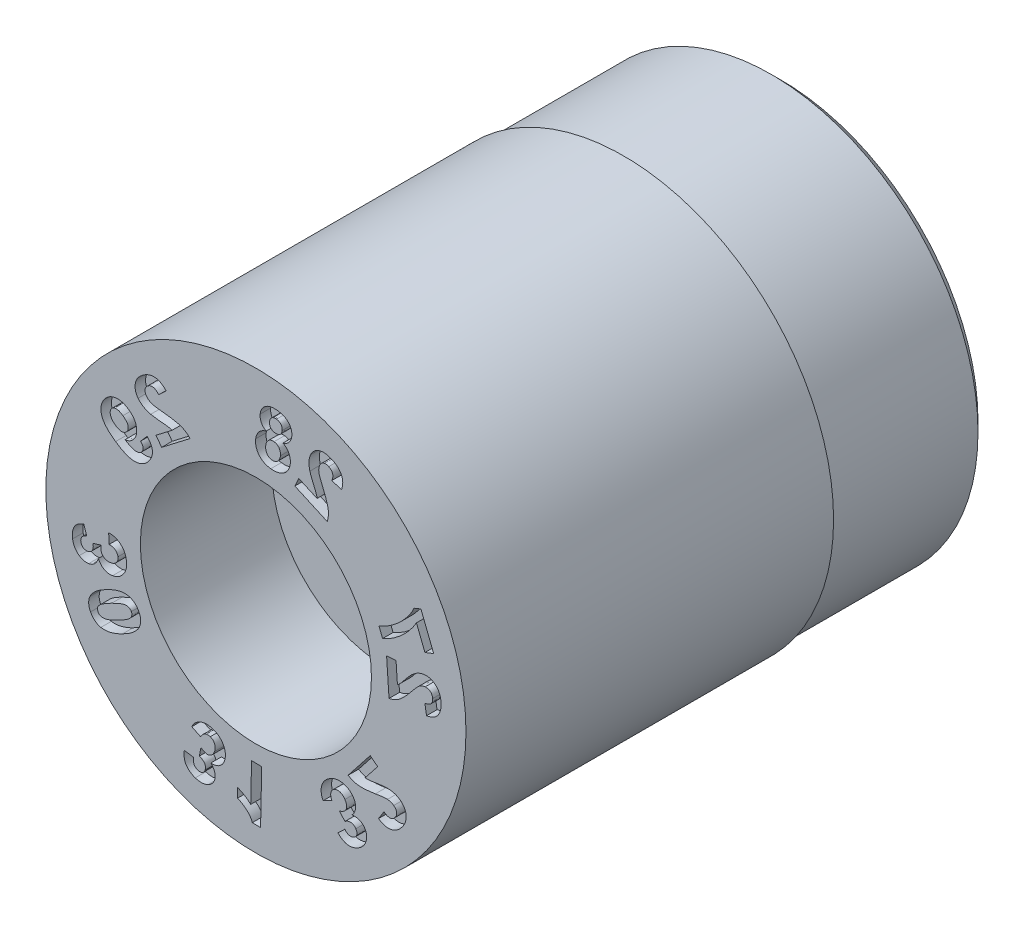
from build123d import *

# Parameters (mm, degrees)
SKETCH4_W          = 3
SKETCH4_H          = 1
CUT_EXTRUDE1_DEPTH = 0.2


with BuildPart() as part:
    # Sketch1 → Revolve1 (revolve)
    with BuildSketch(Plane(origin=(0, 0, 0), x_dir=(0, 0, -1), z_dir=(1, 0, 0)), mode=Mode.PRIVATE) as revolve1_sk:
        Polygon((0, 4), (0, 2.2), (2.5, 2.2), (2.5, 1.15), (10, 1.15), (10, 3.75), (9.75, 4), align=None)
    revolve(revolve1_sk.sketch.rotate(Axis((0, 0, 3.797909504), (0, 0, -1)), 90), axis=Axis((0, 0, 3.797909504), (0, 0, -1)))

    # Sketch4 → Cut-Revolve1 (revolve, cut)
    with BuildSketch(Plane(origin=(0, 0, 0), x_dir=(0, 0, -1), z_dir=(1, 0, 0)), mode=Mode.PRIVATE) as cut_revolve1_sk:
        with Locations((8.5, 4.435)):
            Rectangle(SKETCH4_W, SKETCH4_H)
    revolve(cut_revolve1_sk.sketch.rotate(Axis((0, 0, 0), (0, 0, -1)), 90), axis=Axis((0, 0, 0), (0, 0, -1)), mode=Mode.SUBTRACT)

    # Sketch6 → Cut-Extrude1 (cut)
    # profile 1 of 12: a face of its own
    with BuildSketch(Plane.XY):
        with BuildLine():
            Line((2.668527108, 0.510952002), (2.488483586, 0.498739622))
            Line((2.488483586, 0.498739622), (2.534978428, -0.180710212))
            add(Edge.make_bspline(
                [(2.534978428, -0.180710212), (2.551736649, -0.177217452), (2.58519943, -0.170243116), (2.633559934, -0.152548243), (2.680243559, -0.129960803), (2.717795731, -0.106328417), (2.74785095, -0.083558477), (2.772258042, -0.062960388), (2.798185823, -0.038853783), (2.825698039, -0.011182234), (2.854976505, 0.019887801), (2.885822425, 0.054552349), (2.918228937, 0.092680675), (2.940085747, 0.11946948), (2.951390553, 0.133325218)],
                knots=[0, 0, 0, 0, 1.152282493, 2.3008753, 3.459129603, 4.642367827, 5.283422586, 5.999084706, 6.793588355, 7.668401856, 8.62819688, 9.670160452, 10.794957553, 12, 12, 12, 12], degree=3))
            add(Edge.make_bspline(
                [(2.951390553, 0.133325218), (2.960436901, 0.144357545), (2.977707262, 0.165419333), (3.002545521, 0.1953164), (3.025364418, 0.221700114), (3.04553895, 0.24512614), (3.063819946, 0.264862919), (3.079649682, 0.281506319), (3.093449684, 0.294572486), (3.102130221, 0.301925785), (3.105965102, 0.30517432)],
                knots=[0, 0, 0, 0, 1.479588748, 2.82467939, 4.030685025, 5.097149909, 6.030468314, 6.820327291, 7.478845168, 8, 8, 8, 8], degree=3))
            add(Edge.make_bspline(
                [(3.105965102, 0.30517432), (3.115396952, 0.312022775), (3.133575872, 0.325222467), (3.162887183, 0.339746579), (3.192182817, 0.350010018), (3.212161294, 0.352327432), (3.22199974, 0.353468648)],
                knots=[0, 0, 0, 0, 1.095556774, 2.111572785, 3.070039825, 4, 4, 4, 4], degree=3))
            add(Edge.make_bspline(
                [(3.22199974, 0.353468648), (3.232269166, 0.353844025), (3.251732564, 0.354555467), (3.279396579, 0.34943892), (3.303793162, 0.340278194), (3.324441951, 0.326064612), (3.341331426, 0.30776615), (3.35388076, 0.285592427), (3.362296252, 0.259821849), (3.364310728, 0.241361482), (3.365369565, 0.231658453)],
                knots=[0, 0, 0, 0, 1.152254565, 2.183840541, 3.140332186, 4.061853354, 4.975257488, 5.916609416, 6.904940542, 8, 8, 8, 8], degree=3))
            add(Edge.make_bspline(
                [(3.365369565, 0.231658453), (3.365615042, 0.222001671), (3.366087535, 0.203414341), (3.361106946, 0.176629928), (3.350843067, 0.152779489), (3.338499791, 0.135327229), (3.326140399, 0.123059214), (3.315067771, 0.114832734), (3.302583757, 0.107287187), (3.288557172, 0.100521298), (3.272753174, 0.095037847), (3.255594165, 0.08986375), (3.236763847, 0.085880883), (3.22367351, 0.083940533), (3.216867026, 0.082931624)],
                knots=[0, 0, 0, 0, 1.462337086, 2.814699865, 4.093748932, 5.372505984, 6.029478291, 6.727784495, 7.458861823, 8.23962606, 9.084454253, 9.993115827, 10.956495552, 12, 12, 12, 12], degree=3))
            Line((3.216867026, 0.082931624), (3.249289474, -0.108951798))
            add(Edge.make_bspline(
                [(3.249289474, -0.108951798), (3.262102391, -0.106499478), (3.286888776, -0.101755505), (3.322197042, -0.091341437), (3.354603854, -0.079099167), (3.384166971, -0.06482308), (3.410527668, -0.047988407), (3.43409114, -0.029346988), (3.454511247, -0.008322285), (3.472026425, 0.014607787), (3.486686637, 0.039334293), (3.499337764, 0.065232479), (3.509220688, 0.092595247), (3.517483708, 0.121056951), (3.522823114, 0.150895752), (3.526239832, 0.181956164), (3.527335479, 0.214250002), (3.526283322, 0.236176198), (3.525748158, 0.247328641)],
                knots=[0, 0, 0, 0, 1.24027648, 2.399295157, 3.496247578, 4.532905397, 5.515712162, 6.465684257, 7.384482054, 8.296125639, 9.203708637, 10.11470743, 11.033528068, 11.96761624, 12.930512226, 13.912571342, 14.938259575, 16, 16, 16, 16], degree=3))
            add(Edge.make_bspline(
                [(3.525748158, 0.247328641), (3.5246725, 0.259485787), (3.522574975, 0.283192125), (3.516234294, 0.317413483), (3.508041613, 0.349579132), (3.497037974, 0.379473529), (3.483706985, 0.407288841), (3.467932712, 0.432908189), (3.449758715, 0.456336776), (3.429313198, 0.477357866), (3.407138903, 0.495861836), (3.38386309, 0.511966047), (3.359446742, 0.525101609), (3.334064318, 0.535637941), (3.307551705, 0.542976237), (3.280036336, 0.547974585), (3.251448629, 0.549968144), (3.232107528, 0.549236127), (3.222301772, 0.548865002)],
                knots=[0, 0, 0, 0, 1.218073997, 2.375234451, 3.471050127, 4.528894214, 5.55052617, 6.546295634, 7.527371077, 8.505424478, 9.468441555, 10.407210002, 11.326763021, 12.231943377, 13.145541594, 14.068208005, 15.020599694, 16, 16, 16, 16], degree=3))
            add(Edge.make_bspline(
                [(3.222301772, 0.548865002), (3.211105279, 0.547796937), (3.188826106, 0.545671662), (3.156099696, 0.538821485), (3.124486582, 0.528680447), (3.093499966, 0.515988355), (3.062945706, 0.499412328), (3.03225857, 0.479363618), (3.000795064, 0.45601344), (2.98059223, 0.43824991), (2.970145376, 0.429064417)],
                knots=[0, 0, 0, 0, 0.947186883, 1.884745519, 2.810283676, 3.741497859, 4.702012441, 5.734126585, 6.828320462, 8, 8, 8, 8], degree=3))
            add(Edge.make_bspline(
                [(2.970145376, 0.429064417), (2.966404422, 0.425621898), (2.958372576, 0.418230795), (2.946196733, 0.405788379), (2.932894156, 0.391500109), (2.918424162, 0.375446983), (2.902768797, 0.357641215), (2.886052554, 0.337912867), (2.868292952, 0.316254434), (2.849824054, 0.293446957), (2.831652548, 0.270775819), (2.814740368, 0.249683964), (2.79914253, 0.231000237), (2.785634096, 0.214202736), (2.773229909, 0.199993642), (2.762831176, 0.187734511), (2.753932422, 0.177780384), (2.740132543, 0.1637153), (2.721688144, 0.145422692), (2.70358229, 0.132248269), (2.694963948, 0.125977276)],
                knots=[0, 0, 0, 0, 0.668942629, 1.436222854, 2.290125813, 3.238062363, 4.280258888, 5.410186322, 6.640786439, 7.96615302, 9.27231679, 10.464451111, 11.523811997, 12.4752592, 13.300746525, 14.005652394, 14.590940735, 15.057111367, 16.599192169, 18, 18, 18, 18], degree=3))
            Line((2.694963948, 0.125977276), (2.668527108, 0.510952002))
        make_face()
    # profile 2 of 12: a face of its own
    with BuildSketch(Plane.XY):
        with BuildLine():
            Line((3.218253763, 0.918036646), (3.385125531, 0.983882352))
            Line((3.385125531, 0.983882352), (3.142301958, 1.597524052))
            Line((3.142301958, 1.597524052), (3.011876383, 1.545993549))
            add(Edge.make_bspline(
                [(3.011876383, 1.545993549), (3.007929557, 1.537018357), (2.999819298, 1.518575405), (2.985448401, 1.490939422), (2.969215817, 1.462386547), (2.951281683, 1.432709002), (2.93079052, 1.402538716), (2.908560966, 1.371278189), (2.884419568, 1.33907581), (2.849509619, 1.295094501), (2.802679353, 1.241104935), (2.742351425, 1.179429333), (2.67741731, 1.122165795), (2.620586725, 1.077598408), (2.57398019, 1.04439757), (2.539603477, 1.02094526), (2.50558088, 0.999482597), (2.472197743, 0.979583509), (2.439402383, 0.961280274), (2.40697482, 0.945024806), (2.375240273, 0.930087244), (2.353887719, 0.921550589), (2.343396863, 0.917356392)],
                knots=[0, 0, 0, 0, 0.62757239, 1.289586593, 1.992959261, 2.730301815, 3.508811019, 4.327195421, 5.18601696, 6.08511705, 7.921743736, 9.758991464, 11.604206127, 13.460449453, 14.379926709, 15.267415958, 16.124309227, 16.954824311, 17.755404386, 18.52807904, 19.276821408, 20, 20, 20, 20], degree=3))
            Line((2.343396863, 0.917356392), (2.411799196, 0.744477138))
            add(Edge.make_bspline(
                [(2.411799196, 0.744477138), (2.427806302, 0.751426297), (2.459967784, 0.76538855), (2.507051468, 0.789342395), (2.553523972, 0.815553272), (2.599335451, 0.844057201), (2.644668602, 0.874715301), (2.689142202, 0.907945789), (2.733181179, 0.943276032), (2.776151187, 0.980967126), (2.81794745, 1.020182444), (2.858099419, 1.060574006), (2.896112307, 1.102228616), (2.932285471, 1.144854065), (2.966587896, 1.188428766), (2.998597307, 1.233246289), (3.029022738, 1.2789225), (3.047557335, 1.310412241), (3.056822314, 1.326153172)],
                knots=[0, 0, 0, 0, 0.948374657, 1.905474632, 2.869850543, 3.847859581, 4.837536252, 5.843701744, 6.864775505, 7.905756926, 8.949782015, 9.979663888, 11.00073765, 12.0142596, 13.017997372, 14.014161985, 15.007329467, 16, 16, 16, 16], degree=3))
            Line((3.056822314, 1.326153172), (3.218253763, 0.918036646))
        make_face()
    # profile 3 of 12: a face of its own
    with BuildSketch(Plane.XY):
        with BuildLine():
            Line((0.815138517, 2.588299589), (0.741741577, 2.42487792))
            Line((0.741741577, 2.42487792), (1.358797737, 2.147716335))
            add(Edge.make_bspline(
                [(1.358797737, 2.147716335), (1.363539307, 2.16400519), (1.373000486, 2.196507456), (1.379861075, 2.247066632), (1.381989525, 2.298446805), (1.378850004, 2.342331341), (1.373316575, 2.379335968), (1.366451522, 2.41032031), (1.35756371, 2.444451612), (1.346080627, 2.48156701), (1.332584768, 2.521762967), (1.31698686, 2.565106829), (1.29881812, 2.611395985), (1.2855218, 2.64312776), (1.278646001, 2.65953691)],
                knots=[0, 0, 0, 0, 1.14992847, 2.294530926, 3.451839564, 4.635207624, 5.273692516, 5.989777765, 6.787695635, 7.666767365, 8.625718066, 9.665151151, 10.792601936, 12, 12, 12, 12], degree=3))
            add(Edge.make_bspline(
                [(1.278646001, 2.65953691), (1.273149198, 2.672599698), (1.262639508, 2.697575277), (1.248023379, 2.733354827), (1.235560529, 2.765735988), (1.224810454, 2.794452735), (1.215923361, 2.819674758), (1.208618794, 2.841265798), (1.20330025, 2.859428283), (1.201067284, 2.870485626), (1.200076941, 2.875389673)],
                knots=[0, 0, 0, 0, 1.478894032, 2.827591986, 4.032940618, 5.099410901, 6.027230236, 6.823276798, 7.478111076, 8, 8, 8, 8], degree=3))
            add(Edge.make_bspline(
                [(1.200076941, 2.875389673), (1.198576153, 2.886781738), (1.195675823, 2.908797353), (1.196624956, 2.941181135), (1.201354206, 2.971589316), (1.208591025, 2.990166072), (1.212142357, 2.999282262)],
                knots=[0, 0, 0, 0, 1.091188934, 2.108765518, 3.071912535, 4, 4, 4, 4], degree=3))
            add(Edge.make_bspline(
                [(1.212142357, 2.999282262), (1.216604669, 3.008451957), (1.225075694, 3.025859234), (1.242418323, 3.047789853), (1.26189278, 3.064883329), (1.284041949, 3.076332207), (1.3080224, 3.08253025), (1.333402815, 3.083219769), (1.359967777, 3.078389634), (1.377123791, 3.071457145), (1.386127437, 3.067818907)],
                knots=[0, 0, 0, 0, 1.149529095, 2.182206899, 3.136774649, 4.057120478, 4.972787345, 5.912971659, 6.904706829, 8, 8, 8, 8], degree=3))
            add(Edge.make_bspline(
                [(1.386127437, 3.067818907), (1.394730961, 3.063577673), (1.411279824, 3.055419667), (1.432172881, 3.038278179), (1.448557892, 3.018397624), (1.458134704, 2.999365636), (1.462845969, 2.982747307), (1.465271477, 2.969285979), (1.465941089, 2.95479861), (1.464819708, 2.939415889), (1.462714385, 2.922992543), (1.459008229, 2.905549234), (1.453607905, 2.887204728), (1.449173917, 2.874803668), (1.446884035, 2.868399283)],
                knots=[0, 0, 0, 0, 1.461569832, 2.811326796, 4.092304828, 5.374592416, 6.030904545, 6.726931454, 7.459861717, 8.23981557, 9.080696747, 9.988097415, 10.960975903, 12, 12, 12, 12], degree=3))
            Line((1.446884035, 2.868399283), (1.630153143, 2.807105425))
            add(Edge.make_bspline(
                [(1.630153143, 2.807105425), (1.633898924, 2.819479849), (1.641158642, 2.843462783), (1.648649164, 2.879165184), (1.653299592, 2.913253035), (1.654223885, 2.945825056), (1.652239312, 2.97680024), (1.646645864, 3.006101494), (1.638194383, 3.033917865), (1.625948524, 3.059907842), (1.611073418, 3.084280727), (1.594191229, 3.107402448), (1.575201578, 3.129220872), (1.553896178, 3.14953979), (1.530374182, 3.168300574), (1.504741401, 3.185752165), (1.476916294, 3.201795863), (1.457198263, 3.21115949), (1.447152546, 3.215929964)],
                knots=[0, 0, 0, 0, 1.237848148, 2.399079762, 3.490230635, 4.528642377, 5.515076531, 6.457108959, 7.379810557, 8.292098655, 9.200600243, 10.111347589, 11.031208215, 11.967371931, 12.927260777, 13.909825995, 14.935121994, 16, 16, 16, 16], degree=3))
            add(Edge.make_bspline(
                [(1.447152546, 3.215929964), (1.436007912, 3.220629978), (1.414312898, 3.229779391), (1.381519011, 3.240607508), (1.349409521, 3.24802996), (1.318075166, 3.252790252), (1.287481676, 3.253834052), (1.257688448, 3.25206873), (1.228656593, 3.247256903), (1.200663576, 3.239021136), (1.174137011, 3.228246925), (1.149188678, 3.215379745), (1.126263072, 3.200255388), (1.105120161, 3.183016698), (1.08603288, 3.163400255), (1.069158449, 3.141362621), (1.05364055, 3.117513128), (1.045380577, 3.100189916), (1.041179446, 3.091379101)],
                knots=[0, 0, 0, 0, 1.216569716, 2.368269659, 3.469109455, 4.528965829, 5.551598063, 6.542612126, 7.527519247, 8.505297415, 9.471870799, 10.404198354, 11.324793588, 12.229932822, 13.143847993, 14.07115112, 15.018961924, 16, 16, 16, 16], degree=3))
            add(Edge.make_bspline(
                [(1.041179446, 3.091379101), (1.036846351, 3.080997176), (1.028252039, 3.060405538), (1.01928716, 3.028298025), (1.012678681, 2.995901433), (1.009968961, 2.962639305), (1.010080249, 2.928208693), (1.013287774, 2.892008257), (1.018943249, 2.853601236), (1.024997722, 2.82756978), (1.028128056, 2.81411078)],
                knots=[0, 0, 0, 0, 0.952702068, 1.889601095, 2.820254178, 3.751301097, 4.712552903, 5.735530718, 6.829205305, 8, 8, 8, 8], degree=3))
            add(Edge.make_bspline(
                [(1.028128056, 2.81411078), (1.029435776, 2.809194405), (1.032224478, 2.798710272), (1.037378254, 2.782206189), (1.043429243, 2.763881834), (1.0509196, 2.743829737), (1.059195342, 2.721748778), (1.06868276, 2.697856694), (1.079425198, 2.672182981), (1.090678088, 2.645325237), (1.102062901, 2.618850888), (1.112397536, 2.594037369), (1.121834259, 2.571834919), (1.129821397, 2.551944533), (1.136732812, 2.534591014), (1.142557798, 2.519697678), (1.147128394, 2.507263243), (1.153298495, 2.488685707), (1.160376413, 2.463877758), (1.163278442, 2.441808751), (1.164661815, 2.431288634)],
                knots=[0, 0, 0, 0, 0.674158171, 1.437637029, 2.291017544, 3.231384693, 4.274138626, 5.416275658, 6.638033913, 7.962511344, 9.275558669, 10.45731505, 11.524894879, 12.47272726, 13.297905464, 14.00047155, 14.59217653, 15.053238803, 16.595302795, 18, 18, 18, 18], degree=3))
            Line((1.164661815, 2.431288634), (0.815138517, 2.588299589))
        make_face()
    # profile 4 of 12: a face of its own
    with BuildSketch(Plane.XY):
        with BuildLine():
            add(Edge.make_bspline(
                [(0.516151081, 3.021020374), (0.522465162, 3.022950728), (0.534907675, 3.026754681), (0.552626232, 3.033972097), (0.56930652, 3.041853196), (0.584810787, 3.050571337), (0.59912549, 3.060245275), (0.612069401, 3.070945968), (0.624163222, 3.082202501), (0.638179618, 3.098718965), (0.653100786, 3.120920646), (0.667241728, 3.149487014), (0.677543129, 3.17981348), (0.680738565, 3.200983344), (0.682349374, 3.211655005)],
                knots=[0, 0, 0, 0, 0.881383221, 1.73685173, 2.552259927, 3.344038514, 4.110111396, 4.856046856, 5.585154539, 6.313410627, 7.744276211, 9.145341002, 10.56097552, 12, 12, 12, 12], degree=3))
            add(Edge.make_bspline(
                [(0.682349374, 3.211655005), (0.683221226, 3.220792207), (0.684936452, 3.238768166), (0.684089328, 3.265502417), (0.680970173, 3.291296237), (0.675191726, 3.316199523), (0.666605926, 3.34009145), (0.65562697, 3.36313677), (0.641875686, 3.385087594), (0.625886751, 3.406141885), (0.607172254, 3.425545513), (0.586130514, 3.443167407), (0.562790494, 3.458780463), (0.536955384, 3.472077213), (0.508883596, 3.483535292), (0.47841791, 3.492596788), (0.445753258, 3.499903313), (0.423094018, 3.502965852), (0.411441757, 3.504540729)],
                knots=[0, 0, 0, 0, 0.978630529, 1.925296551, 2.84742693, 3.747789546, 4.646948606, 5.551613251, 6.466410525, 7.406328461, 8.367942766, 9.336563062, 10.330139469, 11.357847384, 12.432073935, 13.560968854, 14.745755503, 16, 16, 16, 16], degree=3))
            add(Edge.make_bspline(
                [(0.411441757, 3.504540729), (0.399857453, 3.505686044), (0.377299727, 3.507916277), (0.344135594, 3.508246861), (0.312640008, 3.506336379), (0.282926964, 3.50140437), (0.254808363, 3.494536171), (0.228675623, 3.484425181), (0.203952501, 3.472435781), (0.181311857, 3.45754112), (0.160570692, 3.440833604), (0.142125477, 3.42242086), (0.126090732, 3.402504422), (0.112153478, 3.381277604), (0.100705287, 3.358394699), (0.091665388, 3.33399109), (0.084932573, 3.308070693), (0.082317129, 3.290179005), (0.080983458, 3.281055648)],
                knots=[0, 0, 0, 0, 1.24300036, 2.420452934, 3.538995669, 4.609115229, 5.634210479, 6.625036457, 7.596683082, 8.564125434, 9.513031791, 10.437752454, 11.342419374, 12.240036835, 13.145347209, 14.069466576, 15.015579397, 16, 16, 16, 16], degree=3))
            add(Edge.make_bspline(
                [(0.080983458, 3.281055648), (0.080060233, 3.269652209), (0.078254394, 3.247346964), (0.081499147, 3.214172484), (0.089476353, 3.182437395), (0.102274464, 3.152363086), (0.119154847, 3.124295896), (0.140719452, 3.099194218), (0.165813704, 3.07640821), (0.185252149, 3.064254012), (0.195137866, 3.05807281)],
                knots=[0, 0, 0, 0, 1.030728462, 2.016115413, 2.991968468, 3.972975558, 4.955194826, 5.934891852, 6.949757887, 8, 8, 8, 8], degree=3))
            add(Edge.make_bspline(
                [(0.195137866, 3.05807281), (0.188023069, 3.055969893), (0.174077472, 3.051848), (0.153882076, 3.044326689), (0.134869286, 3.035585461), (0.116940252, 3.025725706), (0.100317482, 3.014614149), (0.084544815, 3.002783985), (0.070123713, 2.989538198), (0.05695615, 2.975136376), (0.044709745, 2.960074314), (0.034127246, 2.943925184), (0.024345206, 2.927302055), (0.016390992, 2.909583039), (0.009290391, 2.89129069), (0.003524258, 2.872223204), (-0.000637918, 2.85229891), (-0.002564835, 2.838720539), (-0.003544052, 2.831820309)],
                knots=[0, 0, 0, 0, 1.107738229, 2.171259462, 3.214995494, 4.230344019, 5.22328387, 6.198721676, 7.172035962, 8.142209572, 9.111262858, 10.067202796, 11.022926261, 11.98839649, 12.963675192, 13.952177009, 14.959341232, 16, 16, 16, 16], degree=3))
            add(Edge.make_bspline(
                [(-0.003544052, 2.831820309), (-0.004607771, 2.820485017), (-0.006689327, 2.798303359), (-0.005980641, 2.765453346), (-0.002786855, 2.733856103), (0.003606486, 2.703553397), (0.012773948, 2.674519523), (0.025157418, 2.646888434), (0.040537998, 2.620597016), (0.058450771, 2.595623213), (0.079156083, 2.572730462), (0.102145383, 2.552183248), (0.127240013, 2.534090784), (0.154397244, 2.518374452), (0.183835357, 2.505493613), (0.215367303, 2.495014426), (0.248989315, 2.486792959), (0.272332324, 2.483679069), (0.284258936, 2.482088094)],
                knots=[0, 0, 0, 0, 1.070912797, 2.095633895, 3.087144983, 4.056604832, 5.005494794, 5.947973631, 6.900387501, 7.8684047, 8.835890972, 9.799887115, 10.765523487, 11.743153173, 12.747842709, 13.784527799, 14.868051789, 16, 16, 16, 16], degree=3))
            add(Edge.make_bspline(
                [(0.284258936, 2.482088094), (0.295446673, 2.481072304), (0.317400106, 2.479079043), (0.349882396, 2.478524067), (0.381171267, 2.48071444), (0.411298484, 2.485180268), (0.440296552, 2.492076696), (0.46819178, 2.501249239), (0.494788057, 2.513137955), (0.511537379, 2.522775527), (0.519900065, 2.527587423)],
                knots=[0, 0, 0, 0, 1.102054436, 2.162535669, 3.183536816, 4.176327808, 5.147653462, 6.104712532, 7.053711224, 8, 8, 8, 8], degree=3))
            add(Edge.make_bspline(
                [(0.519900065, 2.527587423), (0.529257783, 2.533829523), (0.547679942, 2.546118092), (0.572464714, 2.567934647), (0.594143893, 2.592075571), (0.612639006, 2.618612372), (0.627823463, 2.647493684), (0.639872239, 2.678664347), (0.649145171, 2.712174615), (0.652452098, 2.735563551), (0.654145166, 2.747538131)],
                knots=[0, 0, 0, 0, 1.009509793, 1.987380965, 2.956563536, 3.917660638, 4.885142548, 5.880106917, 6.914665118, 8, 8, 8, 8], degree=3))
            add(Edge.make_bspline(
                [(0.654145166, 2.747538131), (0.655177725, 2.760873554), (0.657220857, 2.78726045), (0.654081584, 2.826658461), (0.645672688, 2.864920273), (0.634246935, 2.895586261), (0.622660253, 2.919272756), (0.612102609, 2.93630629), (0.599721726, 2.95234994), (0.586336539, 2.967993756), (0.571000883, 2.982473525), (0.554308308, 2.996312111), (0.535874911, 3.009192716), (0.522801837, 3.017032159), (0.516151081, 3.021020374)],
                knots=[0, 0, 0, 0, 1.474522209, 2.917647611, 4.343280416, 5.786072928, 6.517581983, 7.251135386, 7.993228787, 8.752635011, 9.521029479, 10.317802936, 11.144204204, 12, 12, 12, 12], degree=3))
        make_face()
        with BuildLine():
            add(Edge.make_bspline(
                [(0.498961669, 3.218965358), (0.497518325, 3.209932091), (0.494761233, 3.192676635), (0.485915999, 3.168874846), (0.473041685, 3.148829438), (0.45681838, 3.132428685), (0.437230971, 3.120458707), (0.415357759, 3.112571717), (0.391098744, 3.109319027), (0.374469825, 3.110450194), (0.365792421, 3.111040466)],
                knots=[0, 0, 0, 0, 1.131376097, 2.161168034, 3.119193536, 4.062731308, 4.993431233, 5.938890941, 6.924459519, 8, 8, 8, 8], degree=3))
            add(Edge.make_bspline(
                [(0.365792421, 3.111040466), (0.357147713, 3.112368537), (0.340524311, 3.114922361), (0.317640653, 3.12395408), (0.297999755, 3.136693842), (0.281628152, 3.152954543), (0.269279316, 3.172761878), (0.261124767, 3.19535143), (0.258004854, 3.220712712), (0.259217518, 3.23815748), (0.259853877, 3.247311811)],
                knots=[0, 0, 0, 0, 1.073864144, 2.064994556, 3.001098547, 3.938590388, 4.881128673, 5.850753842, 6.872159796, 8, 8, 8, 8], degree=3))
            add(Edge.make_bspline(
                [(0.259853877, 3.247311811), (0.261242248, 3.2558762), (0.263900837, 3.272276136), (0.272922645, 3.29490823), (0.285474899, 3.3145296), (0.301988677, 3.330380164), (0.32116689, 3.342815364), (0.342938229, 3.350544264), (0.366800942, 3.354358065), (0.383191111, 3.353065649), (0.391726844, 3.35239258)],
                knots=[0, 0, 0, 0, 1.094581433, 2.096012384, 3.057945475, 4.018604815, 4.968934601, 5.927041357, 6.920436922, 8, 8, 8, 8], degree=3))
            add(Edge.make_bspline(
                [(0.391726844, 3.35239258), (0.400494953, 3.351010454), (0.417288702, 3.348363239), (0.440637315, 3.339582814), (0.460453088, 3.326592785), (0.476794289, 3.310048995), (0.489000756, 3.290450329), (0.49731179, 3.268496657), (0.500639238, 3.244225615), (0.4995335, 3.227575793), (0.498961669, 3.218965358)],
                knots=[0, 0, 0, 0, 1.10224315, 2.111150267, 3.076051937, 4.028033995, 4.980619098, 5.927611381, 6.928266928, 8, 8, 8, 8], degree=3))
        make_face(mode=Mode.SUBTRACT)
        with BuildLine():
            add(Edge.make_bspline(
                [(0.467149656, 2.787803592), (0.466324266, 2.781358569), (0.464719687, 2.768829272), (0.460378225, 2.750888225), (0.455211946, 2.734156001), (0.449211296, 2.718497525), (0.441503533, 2.704278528), (0.433063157, 2.691075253), (0.423320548, 2.67918449), (0.412391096, 2.668796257), (0.400891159, 2.659450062), (0.388510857, 2.651927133), (0.37584585, 2.645536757), (0.362699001, 2.640559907), (0.349044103, 2.637333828), (0.334981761, 2.635213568), (0.320434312, 2.634927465), (0.310636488, 2.635735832), (0.305680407, 2.636144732)],
                knots=[0, 0, 0, 0, 1.252160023, 2.434233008, 3.553413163, 4.628890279, 5.661070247, 6.666497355, 7.647434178, 8.616516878, 9.570348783, 10.499073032, 11.403804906, 12.303565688, 13.202271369, 14.104712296, 15.041297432, 16, 16, 16, 16], degree=3))
            add(Edge.make_bspline(
                [(0.305680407, 2.636144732), (0.300809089, 2.636831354), (0.291278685, 2.638174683), (0.277511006, 2.641875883), (0.264581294, 2.646755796), (0.252447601, 2.652982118), (0.241209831, 2.66055373), (0.230444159, 2.669039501), (0.220944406, 2.679260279), (0.211885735, 2.690281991), (0.204151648, 2.702650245), (0.197458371, 2.715985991), (0.192582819, 2.730603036), (0.188526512, 2.74609491), (0.186552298, 2.762749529), (0.185245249, 2.780287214), (0.185723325, 2.798890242), (0.186944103, 2.811571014), (0.187570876, 2.818081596)],
                knots=[0, 0, 0, 0, 0.965007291, 1.887971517, 2.791853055, 3.673912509, 4.558097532, 5.44913056, 6.35774656, 7.291207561, 8.246158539, 9.215140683, 10.212937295, 11.265405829, 12.353042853, 13.499261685, 14.716066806, 16, 16, 16, 16], degree=3))
            add(Edge.make_bspline(
                [(0.187570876, 2.818081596), (0.18831614, 2.823776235), (0.18977757, 2.834943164), (0.193567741, 2.851134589), (0.198709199, 2.866245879), (0.204347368, 2.880607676), (0.211750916, 2.893575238), (0.220010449, 2.90568115), (0.229608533, 2.916652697), (0.240069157, 2.926746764), (0.251385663, 2.935586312), (0.263217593, 2.943286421), (0.275865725, 2.948992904), (0.288710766, 2.953952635), (0.302197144, 2.957025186), (0.316158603, 2.958927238), (0.330662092, 2.958954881), (0.340443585, 2.958183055), (0.345399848, 2.957791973)],
                knots=[0, 0, 0, 0, 1.164392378, 2.283320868, 3.365137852, 4.400722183, 5.406391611, 6.386304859, 7.368746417, 8.35728745, 9.330262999, 10.27780207, 11.211954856, 12.139136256, 13.065802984, 14.010013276, 14.991677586, 16, 16, 16, 16], degree=3))
            add(Edge.make_bspline(
                [(0.345399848, 2.957791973), (0.351084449, 2.956999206), (0.362103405, 2.955462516), (0.377880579, 2.951315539), (0.392364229, 2.945855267), (0.405654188, 2.939058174), (0.417330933, 2.93044454), (0.428098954, 2.920886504), (0.437175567, 2.909591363), (0.447513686, 2.893114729), (0.457482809, 2.871172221), (0.465371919, 2.843807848), (0.468982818, 2.815836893), (0.467762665, 2.797177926), (0.467149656, 2.787803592)],
                knots=[0, 0, 0, 0, 0.880196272, 1.706160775, 2.496990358, 3.252424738, 3.988077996, 4.717991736, 5.455943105, 6.202431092, 7.699389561, 9.135869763, 10.561050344, 12, 12, 12, 12], degree=3))
        make_face(mode=Mode.SUBTRACT)
    # profile 5 of 12: a face of its own
    with BuildSketch(Plane.XY):
        with BuildLine():
            Line((-1.904011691, 1.939162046), (-1.793943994, 1.795722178))
            Line((-1.793943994, 1.795722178), (-1.252519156, 2.21139715))
            add(Edge.make_bspline(
                [(-1.252519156, 2.21139715), (-1.264719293, 2.223397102), (-1.28913147, 2.247408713), (-1.330564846, 2.278087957), (-1.375315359, 2.304525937), (-1.415793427, 2.322752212), (-1.451474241, 2.335263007), (-1.482255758, 2.344235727), (-1.51687635, 2.352516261), (-1.555261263, 2.360072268), (-1.597419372, 2.367206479), (-1.643362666, 2.373954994), (-1.693211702, 2.379926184), (-1.727741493, 2.383423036), (-1.745644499, 2.385236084)],
                knots=[0, 0, 0, 0, 1.149253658, 2.299628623, 3.454986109, 4.638276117, 5.276700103, 5.995783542, 6.792681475, 7.668930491, 8.625257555, 9.666860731, 10.790313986, 12, 12, 12, 12], degree=3))
            add(Edge.make_bspline(
                [(-1.745644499, 2.385236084), (-1.75993306, 2.386613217), (-1.787117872, 2.389233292), (-1.825902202, 2.393371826), (-1.860672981, 2.397517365), (-1.89141985, 2.401703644), (-1.918124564, 2.405647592), (-1.940720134, 2.410091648), (-1.959435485, 2.413954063), (-1.970424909, 2.417178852), (-1.975263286, 2.418598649)],
                knots=[0, 0, 0, 0, 1.482944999, 2.821388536, 4.029397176, 5.100235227, 6.027221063, 6.817278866, 7.479276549, 8, 8, 8, 8], degree=3))
            add(Edge.make_bspline(
                [(-1.975263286, 2.418598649), (-1.98607754, 2.422685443), (-2.007001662, 2.430592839), (-2.035191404, 2.447061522), (-2.060060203, 2.465748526), (-2.073046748, 2.481196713), (-2.079435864, 2.488796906)],
                knots=[0, 0, 0, 0, 1.087406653, 2.103984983, 3.067199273, 4, 4, 4, 4], degree=3))
            add(Edge.make_bspline(
                [(-2.079435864, 2.488796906), (-2.085361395, 2.497155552), (-2.096649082, 2.513078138), (-2.10811071, 2.538821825), (-2.113917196, 2.564416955), (-2.113582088, 2.589596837), (-2.10786316, 2.613982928), (-2.09615012, 2.636673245), (-2.079449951, 2.658082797), (-2.065071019, 2.669962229), (-2.057507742, 2.676210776)],
                knots=[0, 0, 0, 0, 1.145825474, 2.182710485, 3.134952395, 4.064102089, 4.980153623, 5.915581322, 6.903601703, 8, 8, 8, 8], degree=3))
            add(Edge.make_bspline(
                [(-2.057507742, 2.676210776), (-2.049529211, 2.681844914), (-2.03426439, 2.692624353), (-2.008937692, 2.702914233), (-1.983457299, 2.707978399), (-1.961951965, 2.707337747), (-1.944908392, 2.703642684), (-1.931880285, 2.699040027), (-1.918624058, 2.692795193), (-1.905418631, 2.684367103), (-1.891652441, 2.67476425), (-1.878090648, 2.662835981), (-1.864096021, 2.649542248), (-1.855195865, 2.639621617), (-1.850613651, 2.634514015)],
                knots=[0, 0, 0, 0, 1.471318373, 2.814980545, 4.09419545, 5.371961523, 6.031128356, 6.722353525, 7.454840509, 8.239242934, 9.085754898, 9.987659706, 10.963953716, 12, 12, 12, 12], degree=3))
            Line((-1.850613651, 2.634514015), (-1.708703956, 2.76824566))
            add(Edge.make_bspline(
                [(-1.708703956, 2.76824566), (-1.717897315, 2.777564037), (-1.735673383, 2.795581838), (-1.763786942, 2.819500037), (-1.792105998, 2.839515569), (-1.820483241, 2.85615824), (-1.849013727, 2.869063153), (-1.877637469, 2.878517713), (-1.906437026, 2.884090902), (-1.935343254, 2.88572364), (-1.964093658, 2.884058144), (-1.99278001, 2.880346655), (-2.021206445, 2.873661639), (-2.049421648, 2.864261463), (-2.077511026, 2.85253753), (-2.10529451, 2.838031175), (-2.132802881, 2.820879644), (-2.15052125, 2.807882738), (-2.15957331, 2.801242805)],
                knots=[0, 0, 0, 0, 1.24138864, 2.40032074, 3.496096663, 4.527460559, 5.516380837, 6.461129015, 7.380889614, 8.290701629, 9.199985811, 10.109522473, 11.031572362, 11.965252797, 12.928056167, 13.915962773, 14.935295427, 16, 16, 16, 16], degree=3))
            add(Edge.make_bspline(
                [(-2.15957331, 2.801242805), (-2.169079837, 2.793578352), (-2.187609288, 2.778639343), (-2.212962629, 2.754690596), (-2.234874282, 2.729660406), (-2.25391157, 2.704011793), (-2.269710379, 2.677465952), (-2.282260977, 2.650116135), (-2.292026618, 2.622094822), (-2.297998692, 2.593284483), (-2.301337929, 2.564556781), (-2.301550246, 2.536248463), (-2.299189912, 2.508590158), (-2.293940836, 2.481537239), (-2.285490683, 2.455200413), (-2.274284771, 2.42952936), (-2.260166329, 2.404515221), (-2.248785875, 2.38885458), (-2.243014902, 2.380913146)],
                knots=[0, 0, 0, 0, 1.217001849, 2.372094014, 3.471220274, 4.528994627, 5.552034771, 6.544312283, 7.524320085, 8.503127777, 9.470972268, 10.402981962, 11.32003466, 12.233990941, 13.143675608, 14.071447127, 15.022040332, 16, 16, 16, 16], degree=3))
            add(Edge.make_bspline(
                [(-2.243014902, 2.380913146), (-2.235923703, 2.372054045), (-2.221831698, 2.354448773), (-2.197655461, 2.331040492), (-2.171743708, 2.310066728), (-2.143702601, 2.291471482), (-2.112976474, 2.275135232), (-2.079344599, 2.260277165), (-2.042432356, 2.247077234), (-2.016423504, 2.239984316), (-2.003012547, 2.236326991)],
                knots=[0, 0, 0, 0, 0.952006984, 1.891878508, 2.818609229, 3.74815891, 4.712199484, 5.737017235, 6.833137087, 8, 8, 8, 8], degree=3))
            add(Edge.make_bspline(
                [(-2.003012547, 2.236326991), (-1.998051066, 2.235100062), (-1.987388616, 2.232463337), (-1.970192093, 2.22927712), (-1.9508862, 2.226141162), (-1.929507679, 2.222594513), (-1.90581646, 2.219931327), (-1.88006284, 2.216758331), (-1.852153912, 2.213800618), (-1.82291677, 2.211243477), (-1.793935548, 2.208727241), (-1.7669801, 2.206185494), (-1.742742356, 2.203806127), (-1.721297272, 2.201495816), (-1.702581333, 2.199176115), (-1.686591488, 2.197450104), (-1.673386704, 2.195297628), (-1.653836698, 2.192196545), (-1.628468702, 2.186095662), (-1.60742054, 2.178277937), (-1.597426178, 2.174565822)],
                knots=[0, 0, 0, 0, 0.670908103, 1.44181204, 2.295130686, 3.239206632, 4.286329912, 5.42449411, 6.646217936, 7.970790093, 9.277737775, 10.465578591, 11.525529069, 12.475305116, 13.297312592, 14.001710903, 14.586318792, 15.053461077, 16.600885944, 18, 18, 18, 18], degree=3))
            Line((-1.597426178, 2.174565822), (-1.904011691, 1.939162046))
        make_face()
    # profile 6 of 12: a face of its own
    with BuildSketch(Plane.XY):
        with BuildLine():
            Line((-2.072984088, 1.837675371), (-2.19725668, 1.694802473))
            add(Edge.make_bspline(
                [(-2.19725668, 1.694802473), (-2.190673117, 1.688568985), (-2.178149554, 1.676711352), (-2.163376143, 1.657033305), (-2.152767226, 1.637304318), (-2.147183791, 1.617095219), (-2.146387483, 1.59681786), (-2.149583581, 1.57659331), (-2.157202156, 1.556565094), (-2.165046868, 1.544220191), (-2.169104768, 1.537834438)],
                knots=[0, 0, 0, 0, 1.222565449, 2.325621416, 3.307936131, 4.231474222, 5.130313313, 6.028210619, 6.980035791, 8, 8, 8, 8], degree=3))
            add(Edge.make_bspline(
                [(-2.169104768, 1.537834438), (-2.172056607, 1.533848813), (-2.177860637, 1.52601211), (-2.188280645, 1.515822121), (-2.199588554, 1.506960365), (-2.21212015, 1.499643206), (-2.225828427, 1.493979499), (-2.240562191, 1.489597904), (-2.256393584, 1.486594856), (-2.273584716, 1.485011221), (-2.292682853, 1.485687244), (-2.313971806, 1.489346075), (-2.337641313, 1.496035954), (-2.363786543, 1.505625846), (-2.392574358, 1.517816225), (-2.423749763, 1.533214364), (-2.457495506, 1.55131734), (-2.480517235, 1.564893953), (-2.492522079, 1.571973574)],
                knots=[0, 0, 0, 0, 0.661440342, 1.300551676, 1.939209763, 2.576246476, 3.231718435, 3.915424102, 4.625718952, 5.380403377, 6.216532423, 7.169866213, 8.257918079, 9.497096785, 10.88689323, 12.430998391, 14.138918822, 16, 16, 16, 16], degree=3))
            add(Edge.make_bspline(
                [(-2.492522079, 1.571973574), (-2.48342658, 1.573220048), (-2.465571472, 1.575666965), (-2.439698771, 1.582146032), (-2.415544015, 1.59148216), (-2.392693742, 1.602898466), (-2.37164507, 1.617189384), (-2.352024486, 1.633767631), (-2.333843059, 1.652703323), (-2.32335344, 1.666988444), (-2.318024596, 1.674245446)],
                knots=[0, 0, 0, 0, 1.053619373, 2.068329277, 3.05368664, 4.021763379, 4.994786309, 5.966897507, 6.967161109, 8, 8, 8, 8], degree=3))
            add(Edge.make_bspline(
                [(-2.318024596, 1.674245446), (-2.312670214, 1.682471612), (-2.302108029, 1.698698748), (-2.289331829, 1.724614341), (-2.279628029, 1.751345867), (-2.273026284, 1.778966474), (-2.269084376, 1.807245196), (-2.268331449, 1.83642941), (-2.270631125, 1.866348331), (-2.275655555, 1.896785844), (-2.283578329, 1.926977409), (-2.294681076, 1.956248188), (-2.308942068, 1.984218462), (-2.325862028, 2.011219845), (-2.346222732, 2.036634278), (-2.369357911, 2.060845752), (-2.395153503, 2.084190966), (-2.414352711, 2.097975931), (-2.42416593, 2.105021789)],
                knots=[0, 0, 0, 0, 0.951026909, 1.876018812, 2.79429167, 3.702752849, 4.624556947, 5.557762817, 6.527452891, 7.529870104, 8.54508281, 9.548869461, 10.558892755, 11.584660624, 12.63300974, 13.709962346, 14.829501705, 16, 16, 16, 16], degree=3))
            add(Edge.make_bspline(
                [(-2.42416593, 2.105021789), (-2.434640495, 2.111934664), (-2.455145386, 2.12546723), (-2.487071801, 2.142515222), (-2.519194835, 2.155834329), (-2.551247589, 2.166243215), (-2.583582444, 2.172798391), (-2.615971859, 2.176051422), (-2.648494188, 2.175815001), (-2.680769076, 2.172213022), (-2.712452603, 2.165504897), (-2.742780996, 2.155476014), (-2.771599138, 2.142589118), (-2.798841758, 2.126686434), (-2.824612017, 2.107940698), (-2.848799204, 2.086083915), (-2.871493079, 2.061360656), (-2.88485589, 2.042962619), (-2.891644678, 2.033615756)],
                knots=[0, 0, 0, 0, 1.133559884, 2.219044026, 3.263980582, 4.272211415, 5.259164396, 6.238954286, 7.208466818, 8.192056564, 9.168536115, 10.129258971, 11.072819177, 12.015736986, 12.974328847, 13.946825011, 14.956913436, 16, 16, 16, 16], degree=3))
            add(Edge.make_bspline(
                [(-2.891644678, 2.033615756), (-2.898515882, 2.023071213), (-2.912020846, 2.002346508), (-2.927906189, 1.969319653), (-2.940143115, 1.935706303), (-2.947752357, 1.901230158), (-2.951767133, 1.866134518), (-2.951216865, 1.830318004), (-2.946743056, 1.793828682), (-2.938488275, 1.75653944), (-2.92511158, 1.71873174), (-2.905656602, 1.68094632), (-2.880966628, 1.642824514), (-2.850066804, 1.604948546), (-2.813880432, 1.566601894), (-2.771829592, 1.52818115), (-2.724254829, 1.48934802), (-2.689677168, 1.464752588), (-2.671770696, 1.452015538)],
                knots=[0, 0, 0, 0, 0.85921854, 1.688745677, 2.497958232, 3.29827578, 4.095420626, 4.906558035, 5.739602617, 6.60379795, 7.511426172, 8.471472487, 9.501248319, 10.609446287, 11.806598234, 13.101200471, 14.498820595, 16, 16, 16, 16], degree=3))
            add(Edge.make_bspline(
                [(-2.671770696, 1.452015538), (-2.653215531, 1.439517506), (-2.617392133, 1.41538827), (-2.56349263, 1.383626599), (-2.511612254, 1.357468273), (-2.461967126, 1.336360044), (-2.414264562, 1.321049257), (-2.368717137, 1.310774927), (-2.325168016, 1.306282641), (-2.28375512, 1.307134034), (-2.244631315, 1.312946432), (-2.207428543, 1.321889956), (-2.172420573, 1.335343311), (-2.139230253, 1.352064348), (-2.108424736, 1.37324007), (-2.079480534, 1.397729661), (-2.05263915, 1.426192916), (-2.036962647, 1.447466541), (-2.028952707, 1.458336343)],
                knots=[0, 0, 0, 0, 1.475122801, 2.847935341, 4.122403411, 5.304491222, 6.401615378, 7.421997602, 8.378148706, 9.281563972, 10.145822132, 10.982094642, 11.799568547, 12.613530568, 13.427294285, 14.258473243, 15.110163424, 16, 16, 16, 16], degree=3))
            add(Edge.make_bspline(
                [(-2.028952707, 1.458336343), (-2.023556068, 1.46638554), (-2.013022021, 1.482097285), (-1.999893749, 1.506658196), (-1.988741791, 1.530940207), (-1.98034862, 1.555379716), (-1.974187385, 1.579685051), (-1.970865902, 1.604051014), (-1.969494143, 1.628325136), (-1.97088322, 1.652538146), (-1.974857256, 1.676570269), (-1.981029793, 1.70047588), (-1.990132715, 1.72405213), (-2.001778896, 1.74733378), (-2.015582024, 1.770619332), (-2.03233603, 1.793408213), (-2.051411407, 1.816064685), (-2.065677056, 1.830355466), (-2.072984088, 1.837675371)],
                knots=[0, 0, 0, 0, 1.100175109, 2.147502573, 3.159602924, 4.132378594, 5.078736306, 6.003079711, 6.921446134, 7.836678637, 8.751616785, 9.684661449, 10.636317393, 11.616327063, 12.639105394, 13.707174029, 14.825587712, 16, 16, 16, 16], degree=3))
        make_face()
        with BuildLine():
            add(Edge.make_bspline(
                [(-2.673273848, 1.718333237), (-2.679461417, 1.722805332), (-2.691484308, 1.731494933), (-2.708075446, 1.745485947), (-2.722868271, 1.759742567), (-2.735569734, 1.774627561), (-2.746783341, 1.789560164), (-2.75574694, 1.805182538), (-2.763357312, 1.820884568), (-2.768515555, 1.837076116), (-2.772406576, 1.852944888), (-2.774387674, 1.868462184), (-2.775000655, 1.883325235), (-2.773870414, 1.897656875), (-2.771472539, 1.911440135), (-2.767316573, 1.92469652), (-2.761610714, 1.937371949), (-2.756521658, 1.945149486), (-2.753967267, 1.949053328)],
                knots=[0, 0, 0, 0, 1.347088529, 2.617489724, 3.827413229, 4.968491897, 6.068231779, 7.117675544, 8.142949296, 9.141372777, 10.110564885, 11.023316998, 11.897658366, 12.731388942, 13.556056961, 14.361577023, 15.177613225, 16, 16, 16, 16], degree=3))
            add(Edge.make_bspline(
                [(-2.753967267, 1.949053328), (-2.748675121, 1.955964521), (-2.738322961, 1.969483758), (-2.717370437, 1.984285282), (-2.693919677, 1.994744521), (-2.672057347, 1.998680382), (-2.653400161, 1.999158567), (-2.638294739, 1.99745882), (-2.622575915, 1.993817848), (-2.606026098, 1.988524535), (-2.588842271, 1.981138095), (-2.57071819, 1.972124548), (-2.5520675, 1.960887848), (-2.539516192, 1.952571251), (-2.533020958, 1.948267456)],
                knots=[0, 0, 0, 0, 1.250932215, 2.446994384, 3.659135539, 4.936979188, 5.624646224, 6.350660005, 7.125686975, 7.952387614, 8.857244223, 9.824912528, 10.874403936, 12, 12, 12, 12], degree=3))
            add(Edge.make_bspline(
                [(-2.533020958, 1.948267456), (-2.526565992, 1.94368252), (-2.514089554, 1.934820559), (-2.497021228, 1.920571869), (-2.481849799, 1.906368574), (-2.468622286, 1.892171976), (-2.45756491, 1.877813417), (-2.448374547, 1.863519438), (-2.441442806, 1.848966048), (-2.436424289, 1.834442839), (-2.433361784, 1.819990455), (-2.431440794, 1.805888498), (-2.431361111, 1.792013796), (-2.432933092, 1.778522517), (-2.435933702, 1.765354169), (-2.440285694, 1.752479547), (-2.446544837, 1.740098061), (-2.451563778, 1.732227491), (-2.454120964, 1.728217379)],
                knots=[0, 0, 0, 0, 1.442617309, 2.788352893, 4.04858028, 5.228868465, 6.320433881, 7.347856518, 8.320022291, 9.251386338, 10.141463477, 11.008652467, 11.841208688, 12.66286552, 13.478876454, 14.299031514, 15.133344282, 16, 16, 16, 16], degree=3))
            add(Edge.make_bspline(
                [(-2.454120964, 1.728217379), (-2.459705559, 1.72109022), (-2.470652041, 1.707120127), (-2.492186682, 1.691117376), (-2.517034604, 1.680510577), (-2.53983697, 1.675827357), (-2.559213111, 1.674907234), (-2.574490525, 1.675806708), (-2.590148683, 1.678490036), (-2.606096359, 1.683267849), (-2.622578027, 1.689237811), (-2.639240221, 1.697312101), (-2.656276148, 1.707042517), (-2.667474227, 1.714480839), (-2.673273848, 1.718333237)],
                knots=[0, 0, 0, 0, 1.319114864, 2.585624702, 3.871940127, 5.242111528, 5.963205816, 6.703230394, 7.475122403, 8.279653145, 9.133908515, 10.035204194, 10.982408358, 12, 12, 12, 12], degree=3))
        make_face(mode=Mode.SUBTRACT)
    # profile 7 of 12: a face of its own
    with BuildSketch(Plane.XY):
        with BuildLine():
            Line((-2.803649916, -0.117713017), (-2.795638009, -0.307330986))
            add(Edge.make_bspline(
                [(-2.795638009, -0.307330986), (-2.784097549, -0.307289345), (-2.762124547, -0.307210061), (-2.730754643, -0.312252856), (-2.702983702, -0.322110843), (-2.678974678, -0.336435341), (-2.659025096, -0.354390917), (-2.643350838, -0.375399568), (-2.631831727, -0.399198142), (-2.628176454, -0.416529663), (-2.626310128, -0.425378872)],
                knots=[0, 0, 0, 0, 1.214768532, 2.312915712, 3.329606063, 4.301956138, 5.240307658, 6.139121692, 7.049864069, 8, 8, 8, 8], degree=3))
            add(Edge.make_bspline(
                [(-2.626310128, -0.425378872), (-2.625643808, -0.43027804), (-2.624332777, -0.439917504), (-2.623962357, -0.454316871), (-2.625474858, -0.468312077), (-2.62810353, -0.482035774), (-2.632578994, -0.495366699), (-2.638270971, -0.508444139), (-2.645972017, -0.520861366), (-2.654598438, -0.533098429), (-2.664868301, -0.54444117), (-2.676137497, -0.55506736), (-2.688890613, -0.564207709), (-2.702717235, -0.57241173), (-2.717817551, -0.579273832), (-2.733893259, -0.585467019), (-2.751288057, -0.590146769), (-2.76334431, -0.592353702), (-2.769561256, -0.593491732)],
                knots=[0, 0, 0, 0, 0.958196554, 1.885320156, 2.78359834, 3.682749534, 4.588565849, 5.504336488, 6.441001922, 7.415705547, 8.403292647, 9.402114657, 10.41273692, 11.438258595, 12.514385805, 13.624251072, 14.774917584, 16, 16, 16, 16], degree=3))
            add(Edge.make_bspline(
                [(-2.769561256, -0.593491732), (-2.775471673, -0.594352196), (-2.786976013, -0.596027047), (-2.804047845, -0.597010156), (-2.820374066, -0.596489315), (-2.836008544, -0.594583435), (-2.850902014, -0.591449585), (-2.865018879, -0.586891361), (-2.878394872, -0.580926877), (-2.894789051, -0.571251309), (-2.912969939, -0.556861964), (-2.930446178, -0.536096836), (-2.942941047, -0.512016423), (-2.946743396, -0.494397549), (-2.948679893, -0.485424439)],
                knots=[0, 0, 0, 0, 0.917606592, 1.786076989, 2.624049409, 3.424643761, 4.203737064, 4.959487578, 5.700229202, 6.449573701, 7.880993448, 9.239727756, 10.594222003, 12, 12, 12, 12], degree=3))
            add(Edge.make_bspline(
                [(-2.948679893, -0.485424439), (-2.949542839, -0.478931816), (-2.951351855, -0.46532117), (-2.951902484, -0.44366779), (-2.951321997, -0.419976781), (-2.949767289, -0.403533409), (-2.948957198, -0.394965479)],
                knots=[0, 0, 0, 0, 0.86601703, 1.81545265, 2.86172687, 4, 4, 4, 4], degree=3))
            Line((-2.948957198, -0.394965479), (-3.102013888, -0.441763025))
            add(Edge.make_bspline(
                [(-3.102013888, -0.441763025), (-3.100868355, -0.448012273), (-3.098634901, -0.46019648), (-3.097271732, -0.478252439), (-3.096705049, -0.495307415), (-3.097861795, -0.511403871), (-3.100309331, -0.526539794), (-3.104104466, -0.540804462), (-3.10934515, -0.554130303), (-3.11616438, -0.566251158), (-3.123673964, -0.577558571), (-3.132637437, -0.587444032), (-3.142310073, -0.596356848), (-3.15295407, -0.604075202), (-3.164600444, -0.610540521), (-3.177082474, -0.616136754), (-3.190684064, -0.620170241), (-3.200068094, -0.622044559), (-3.204840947, -0.622997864)],
                knots=[0, 0, 0, 0, 1.286847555, 2.508976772, 3.666062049, 4.74286641, 5.774197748, 6.769703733, 7.729536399, 8.667476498, 9.584144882, 10.474552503, 11.364639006, 12.246659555, 13.132022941, 14.060671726, 15.013629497, 16, 16, 16, 16], degree=3))
            add(Edge.make_bspline(
                [(-3.204840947, -0.622997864), (-3.212948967, -0.623957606), (-3.228492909, -0.625797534), (-3.251289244, -0.623495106), (-3.272237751, -0.617286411), (-3.290757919, -0.606475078), (-3.306716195, -0.592284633), (-3.319403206, -0.574649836), (-3.328784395, -0.553973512), (-3.332027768, -0.538827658), (-3.333705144, -0.530994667)],
                knots=[0, 0, 0, 0, 1.096877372, 2.102831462, 3.062592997, 4.017916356, 4.966876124, 5.918536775, 6.92352837, 8, 8, 8, 8], degree=3))
            add(Edge.make_bspline(
                [(-3.333705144, -0.530994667), (-3.334568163, -0.522990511), (-3.336259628, -0.507302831), (-3.33326913, -0.483901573), (-3.325659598, -0.461687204), (-3.313607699, -0.440774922), (-3.297014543, -0.421528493), (-3.275219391, -0.405699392), (-3.2496118, -0.391836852), (-3.230340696, -0.385785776), (-3.220245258, -0.382615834)],
                knots=[0, 0, 0, 0, 0.934643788, 1.831847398, 2.71989563, 3.652249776, 4.625897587, 5.653878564, 6.770951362, 8, 8, 8, 8], degree=3))
            Line((-3.220245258, -0.382615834), (-3.279442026, -0.210665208))
            add(Edge.make_bspline(
                [(-3.279442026, -0.210665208), (-3.293329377, -0.216230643), (-3.319954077, -0.226900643), (-3.356708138, -0.245872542), (-3.388410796, -0.266658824), (-3.415838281, -0.288956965), (-3.438495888, -0.314297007), (-3.457502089, -0.342468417), (-3.472943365, -0.373841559), (-3.484867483, -0.40800842), (-3.492856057, -0.444543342), (-3.496220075, -0.482771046), (-3.495880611, -0.522359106), (-3.492270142, -0.548885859), (-3.490427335, -0.562425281)],
                knots=[0, 0, 0, 0, 1.190593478, 2.282594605, 3.286039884, 4.204353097, 5.088063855, 5.981649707, 6.901801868, 7.863829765, 8.8560054, 9.870624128, 10.913153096, 12, 12, 12, 12], degree=3))
            add(Edge.make_bspline(
                [(-3.490427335, -0.562425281), (-3.488320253, -0.573910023), (-3.484207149, -0.596328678), (-3.474231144, -0.628428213), (-3.462413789, -0.658544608), (-3.44760255, -0.686292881), (-3.430354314, -0.711781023), (-3.410592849, -0.735098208), (-3.3881537, -0.756144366), (-3.371555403, -0.768301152), (-3.363198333, -0.774421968)],
                knots=[0, 0, 0, 0, 1.100175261, 2.147584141, 3.164031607, 4.147076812, 5.106979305, 6.061127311, 7.023797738, 8, 8, 8, 8], degree=3))
            add(Edge.make_bspline(
                [(-3.363198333, -0.774421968), (-3.35609196, -0.779037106), (-3.342194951, -0.78806233), (-3.320302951, -0.799102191), (-3.298356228, -0.808228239), (-3.276031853, -0.814743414), (-3.253523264, -0.818926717), (-3.230791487, -0.820770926), (-3.207793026, -0.820463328), (-3.192533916, -0.818441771), (-3.18486068, -0.817425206)],
                knots=[0, 0, 0, 0, 1.080148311, 2.112305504, 3.122509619, 4.108284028, 5.072810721, 6.037924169, 7.013345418, 8, 8, 8, 8], degree=3))
            add(Edge.make_bspline(
                [(-3.18486068, -0.817425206), (-3.174176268, -0.815277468), (-3.153104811, -0.811041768), (-3.123426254, -0.798843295), (-3.096116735, -0.782681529), (-3.071168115, -0.762375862), (-3.049109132, -0.737402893), (-3.029138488, -0.708561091), (-3.01174213, -0.675327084), (-3.002662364, -0.651199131), (-2.997962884, -0.638711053)],
                knots=[0, 0, 0, 0, 0.95763194, 1.888611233, 2.808283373, 3.743789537, 4.707689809, 5.731850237, 6.826057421, 8, 8, 8, 8], degree=3))
            add(Edge.make_bspline(
                [(-2.997962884, -0.638711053), (-2.995166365, -0.645472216), (-2.989651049, -0.658806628), (-2.97960251, -0.677643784), (-2.968251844, -0.695152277), (-2.955755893, -0.711412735), (-2.941793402, -0.72616956), (-2.926879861, -0.739907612), (-2.910388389, -0.751933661), (-2.893007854, -0.762964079), (-2.874517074, -0.772136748), (-2.855523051, -0.780124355), (-2.835799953, -0.785990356), (-2.815537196, -0.78989944), (-2.794790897, -0.792589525), (-2.773421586, -0.79300657), (-2.75144617, -0.792003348), (-2.736726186, -0.789898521), (-2.729224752, -0.788825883)],
                knots=[0, 0, 0, 0, 1.048373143, 2.067608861, 3.055065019, 4.036954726, 5.002544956, 5.964128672, 6.93915006, 7.924238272, 8.91150134, 9.8942644, 10.874891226, 11.854594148, 12.850269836, 13.869599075, 14.91432886, 16, 16, 16, 16], degree=3))
            add(Edge.make_bspline(
                [(-2.729224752, -0.788825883), (-2.718495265, -0.78682051), (-2.697311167, -0.78286114), (-2.6667671, -0.773082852), (-2.637860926, -0.760628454), (-2.610788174, -0.745161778), (-2.585360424, -0.72706761), (-2.561685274, -0.706112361), (-2.539918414, -0.68216216), (-2.519794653, -0.656017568), (-2.502304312, -0.62774272), (-2.48754485, -0.598269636), (-2.476235, -0.567657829), (-2.467616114, -0.536260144), (-2.462595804, -0.503703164), (-2.460853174, -0.470196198), (-2.461614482, -0.435628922), (-2.46495752, -0.412499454), (-2.46665953, -0.400723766)],
                knots=[0, 0, 0, 0, 1.002366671, 1.979054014, 2.940232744, 3.890423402, 4.838942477, 5.803904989, 6.790074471, 7.809188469, 8.83187192, 9.841056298, 10.833345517, 11.826404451, 12.828732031, 13.853960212, 14.907407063, 16, 16, 16, 16], degree=3))
            add(Edge.make_bspline(
                [(-2.46665953, -0.400723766), (-2.468665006, -0.389634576), (-2.472588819, -0.367938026), (-2.48183543, -0.336703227), (-2.492613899, -0.307146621), (-2.506092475, -0.279570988), (-2.521657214, -0.25384969), (-2.539405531, -0.22987054), (-2.559661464, -0.207997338), (-2.581644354, -0.187857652), (-2.605328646, -0.169968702), (-2.630335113, -0.154603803), (-2.656591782, -0.142007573), (-2.683765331, -0.131660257), (-2.71216412, -0.124032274), (-2.741729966, -0.119486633), (-2.772351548, -0.116811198), (-2.793113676, -0.11740943), (-2.803649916, -0.117713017)],
                knots=[0, 0, 0, 0, 1.113380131, 2.178383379, 3.215953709, 4.220753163, 5.207519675, 6.184959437, 7.164739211, 8.150402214, 9.129116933, 10.094771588, 11.047139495, 12.004209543, 12.966053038, 13.948028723, 14.958677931, 16, 16, 16, 16], degree=3))
        make_face()
    # profile 8 of 12: a face of its own
    with BuildSketch(Plane.XY):
        with BuildLine():
            add(Edge.make_bspline(
                [(-3.148182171, -1.595453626), (-3.142516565, -1.605912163), (-3.131431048, -1.626375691), (-3.1118115, -1.654420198), (-3.089970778, -1.678968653), (-3.066299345, -1.70035919), (-3.040637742, -1.718630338), (-3.012836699, -1.733475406), (-2.982992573, -1.745159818), (-2.962038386, -1.750024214), (-2.951394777, -1.752495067)],
                knots=[0, 0, 0, 0, 1.092629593, 2.137876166, 3.137356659, 4.106581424, 5.064438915, 6.02499276, 6.996801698, 8, 8, 8, 8], degree=3))
            add(Edge.make_bspline(
                [(-2.951394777, -1.752495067), (-2.937984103, -1.7546408), (-2.910238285, -1.759080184), (-2.866383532, -1.758875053), (-2.81953913, -1.754093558), (-2.769587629, -1.744106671), (-2.716464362, -1.729289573), (-2.660446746, -1.708821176), (-2.60100207, -1.684181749), (-2.561151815, -1.664441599), (-2.540503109, -1.654213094)],
                knots=[0, 0, 0, 0, 0.757424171, 1.567061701, 2.439865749, 3.384594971, 4.408163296, 5.517001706, 6.713415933, 8, 8, 8, 8], degree=3))
            add(Edge.make_bspline(
                [(-2.540503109, -1.654213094), (-2.530055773, -1.648885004), (-2.509564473, -1.638434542), (-2.47988852, -1.621991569), (-2.45167357, -1.605450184), (-2.424865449, -1.588829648), (-2.399549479, -1.572117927), (-2.375592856, -1.555416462), (-2.353327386, -1.538274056), (-2.332503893, -1.521153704), (-2.313038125, -1.503989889), (-2.295150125, -1.486644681), (-2.278585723, -1.469198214), (-2.26346191, -1.451703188), (-2.250021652, -1.43388658), (-2.238013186, -1.416050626), (-2.227377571, -1.398112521), (-2.221370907, -1.385821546), (-2.218400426, -1.379743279)],
                knots=[0, 0, 0, 0, 1.307373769, 2.564269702, 3.78166843, 4.953407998, 6.080299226, 7.163253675, 8.208386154, 9.212095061, 10.168293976, 11.100803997, 11.988947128, 12.849694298, 13.677490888, 14.475353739, 15.246015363, 16, 16, 16, 16], degree=3))
            add(Edge.make_bspline(
                [(-2.218400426, -1.379743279), (-2.214221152, -1.369804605), (-2.205958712, -1.350155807), (-2.19793591, -1.319417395), (-2.193672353, -1.288356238), (-2.193060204, -1.256984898), (-2.196800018, -1.225358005), (-2.203626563, -1.193327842), (-2.21460378, -1.160949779), (-2.224645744, -1.139983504), (-2.229787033, -1.129249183)],
                knots=[0, 0, 0, 0, 0.994275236, 1.965685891, 2.922087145, 3.883209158, 4.85339827, 5.855356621, 6.901984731, 8, 8, 8, 8], degree=3))
            add(Edge.make_bspline(
                [(-2.229787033, -1.129249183), (-2.235549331, -1.118700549), (-2.246818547, -1.098070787), (-2.267053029, -1.069774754), (-2.289803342, -1.044850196), (-2.314811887, -1.022928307), (-2.342370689, -1.004481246), (-2.37216751, -0.989155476), (-2.404281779, -0.977004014), (-2.438886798, -0.968089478), (-2.476606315, -0.963067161), (-2.517849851, -0.96366847), (-2.562570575, -0.969361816), (-2.610946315, -0.979680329), (-2.662895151, -0.995294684), (-2.718584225, -1.015661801), (-2.777866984, -1.041161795), (-2.81795955, -1.060980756), (-2.838803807, -1.071284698)],
                knots=[0, 0, 0, 0, 0.832129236, 1.627379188, 2.402800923, 3.16529649, 3.925452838, 4.694185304, 5.481671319, 6.299117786, 7.164812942, 8.109418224, 9.147645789, 10.283564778, 11.532068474, 12.90217348, 14.389429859, 16, 16, 16, 16], degree=3))
            add(Edge.make_bspline(
                [(-2.838803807, -1.071284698), (-2.859115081, -1.081888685), (-2.898291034, -1.102341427), (-2.953057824, -1.135497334), (-3.002138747, -1.168871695), (-3.045356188, -1.20292194), (-3.082861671, -1.2372805), (-3.114322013, -1.272417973), (-3.140563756, -1.307759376), (-3.153451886, -1.33293898), (-3.159689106, -1.345124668)],
                knots=[0, 0, 0, 0, 1.281434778, 2.471604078, 3.579010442, 4.599531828, 5.546972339, 6.420045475, 7.235379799, 8, 8, 8, 8], degree=3))
            add(Edge.make_bspline(
                [(-3.159689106, -1.345124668), (-3.163869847, -1.355063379), (-3.172135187, -1.374712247), (-3.180136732, -1.405450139), (-3.184471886, -1.436458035), (-3.184796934, -1.467816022), (-3.181420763, -1.499432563), (-3.174255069, -1.531404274), (-3.16338511, -1.5637567), (-3.153330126, -1.584720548), (-3.148182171, -1.595453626)],
                knots=[0, 0, 0, 0, 0.994853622, 1.966829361, 2.923786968, 3.880330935, 4.85574112, 5.854109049, 6.901345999, 8, 8, 8, 8], degree=3))
        make_face()
        with BuildLine():
            add(Edge.make_bspline(
                [(-3.005283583, -1.522858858), (-3.007621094, -1.517657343), (-3.012238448, -1.507382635), (-3.015747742, -1.490816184), (-3.016508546, -1.473912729), (-3.014172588, -1.456464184), (-3.008001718, -1.438278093), (-2.996644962, -1.419955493), (-2.981159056, -1.400809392), (-2.968341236, -1.388947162), (-2.961487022, -1.382603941)],
                knots=[0, 0, 0, 0, 0.853834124, 1.686604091, 2.523129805, 3.383000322, 4.314163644, 5.3821628, 6.600135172, 8, 8, 8, 8], degree=3))
            add(Edge.make_bspline(
                [(-2.961487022, -1.382603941), (-2.956192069, -1.378091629), (-2.944812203, -1.368393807), (-2.925456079, -1.354332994), (-2.903220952, -1.338995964), (-2.877630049, -1.323206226), (-2.849080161, -1.306200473), (-2.817314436, -1.288489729), (-2.782625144, -1.26943054), (-2.758148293, -1.2570081), (-2.745435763, -1.250556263)],
                knots=[0, 0, 0, 0, 0.657752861, 1.413636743, 2.261210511, 3.212192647, 4.256809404, 5.404092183, 6.651764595, 8, 8, 8, 8], degree=3))
            add(Edge.make_bspline(
                [(-2.745435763, -1.250556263), (-2.73275488, -1.244174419), (-2.708395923, -1.23191541), (-2.673009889, -1.215073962), (-2.640650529, -1.199803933), (-2.610926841, -1.187291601), (-2.584241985, -1.176276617), (-2.560317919, -1.167620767), (-2.539273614, -1.160723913), (-2.51569551, -1.155052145), (-2.490130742, -1.150553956), (-2.462888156, -1.148511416), (-2.439893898, -1.149955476), (-2.420911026, -1.15542556), (-2.405520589, -1.163998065), (-2.392202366, -1.174350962), (-2.380997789, -1.187039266), (-2.375471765, -1.196881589), (-2.372685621, -1.201843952)],
                knots=[0, 0, 0, 0, 1.649564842, 3.168681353, 4.553909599, 5.806716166, 6.915781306, 7.907961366, 8.762756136, 9.487304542, 10.724210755, 11.775042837, 12.655965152, 13.386925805, 14.049567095, 14.691075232, 15.340058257, 16, 16, 16, 16], degree=3))
            add(Edge.make_bspline(
                [(-2.372685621, -1.201843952), (-2.370351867, -1.207045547), (-2.365741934, -1.217320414), (-2.36216663, -1.233938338), (-2.361628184, -1.250901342), (-2.363886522, -1.268412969), (-2.370140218, -1.28648986), (-2.38106471, -1.305007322), (-2.396898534, -1.323823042), (-2.409659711, -1.335732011), (-2.416482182, -1.342098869)],
                knots=[0, 0, 0, 0, 0.853894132, 1.686722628, 2.531325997, 3.391256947, 4.322485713, 5.381421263, 6.600036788, 8, 8, 8, 8], degree=3))
            add(Edge.make_bspline(
                [(-2.416482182, -1.342098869), (-2.421708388, -1.346668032), (-2.432905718, -1.356457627), (-2.452304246, -1.370333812), (-2.47440051, -1.385592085), (-2.499820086, -1.401491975), (-2.528331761, -1.418389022), (-2.560078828, -1.436193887), (-2.594945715, -1.454987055), (-2.619426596, -1.467463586), (-2.632127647, -1.473936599)],
                knots=[0, 0, 0, 0, 0.657297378, 1.408282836, 2.257267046, 3.201446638, 4.247801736, 5.396993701, 6.649521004, 8, 8, 8, 8], degree=3))
            add(Edge.make_bspline(
                [(-2.632127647, -1.473936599), (-2.6448226, -1.480288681), (-2.66917983, -1.492476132), (-2.704381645, -1.509709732), (-2.736914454, -1.524516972), (-2.766545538, -1.53747873), (-2.793296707, -1.548229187), (-2.817173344, -1.55714713), (-2.838331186, -1.5636624), (-2.861857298, -1.569719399), (-2.887494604, -1.573862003), (-2.914677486, -1.576016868), (-2.9377422, -1.574470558), (-2.956865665, -1.56918374), (-2.972340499, -1.560544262), (-2.985583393, -1.550151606), (-2.997030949, -1.537696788), (-3.002515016, -1.52783664), (-3.005283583, -1.522858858)],
                knots=[0, 0, 0, 0, 1.648578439, 3.16305258, 4.551310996, 5.799339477, 6.918638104, 7.899248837, 8.758243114, 9.488424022, 10.718934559, 11.769138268, 12.649533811, 13.390178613, 14.052423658, 14.693548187, 15.340452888, 16, 16, 16, 16], degree=3))
        make_face(mode=Mode.SUBTRACT)
    # profile 9 of 12: a face of its own
    with BuildSketch(Plane.XY):
        with BuildLine():
            Line((-1.221168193, -2.524776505), (-1.051342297, -2.606880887))
            add(Edge.make_bspline(
                [(-1.051342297, -2.606880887), (-1.045923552, -2.596819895), (-1.035590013, -2.577633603), (-1.016378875, -2.552609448), (-0.99473794, -2.532858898), (-0.970832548, -2.518708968), (-0.945826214, -2.509436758), (-0.919986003, -2.505370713), (-0.893676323, -2.506777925), (-0.876718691, -2.511555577), (-0.868072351, -2.513991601)],
                knots=[0, 0, 0, 0, 1.209769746, 2.307028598, 3.326543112, 4.295747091, 5.233108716, 6.136960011, 7.050075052, 8, 8, 8, 8], degree=3))
            add(Edge.make_bspline(
                [(-0.868072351, -2.513991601), (-0.859119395, -2.517664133), (-0.841569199, -2.52486328), (-0.818651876, -2.541926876), (-0.800241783, -2.563820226), (-0.788627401, -2.585294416), (-0.781906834, -2.604152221), (-0.778036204, -2.619018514), (-0.776005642, -2.63449179), (-0.775518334, -2.650451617), (-0.776276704, -2.66696323), (-0.778961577, -2.683896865), (-0.782824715, -2.701411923), (-0.786543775, -2.71305393), (-0.788453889, -2.71903328)],
                knots=[0, 0, 0, 0, 1.410154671, 2.764281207, 4.126978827, 5.562207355, 6.305061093, 7.049779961, 7.802966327, 8.580429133, 9.381247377, 10.214686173, 11.083060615, 12, 12, 12, 12], degree=3))
            add(Edge.make_bspline(
                [(-0.788453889, -2.71903328), (-0.790508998, -2.724569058), (-0.794536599, -2.735418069), (-0.80155273, -2.750927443), (-0.809599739, -2.76503702), (-0.818740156, -2.777688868), (-0.828375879, -2.789256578), (-0.838965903, -2.799619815), (-0.85054303, -2.808488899), (-0.866734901, -2.818327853), (-0.887830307, -2.827618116), (-0.914336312, -2.832615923), (-0.941295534, -2.832497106), (-0.958529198, -2.827472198), (-0.967317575, -2.824909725)],
                knots=[0, 0, 0, 0, 0.912595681, 1.788503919, 2.628233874, 3.418459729, 4.198166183, 4.953026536, 5.703764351, 6.446785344, 7.879395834, 9.237212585, 10.591105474, 12, 12, 12, 12], degree=3))
            add(Edge.make_bspline(
                [(-0.967317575, -2.824909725), (-0.973443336, -2.822632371), (-0.986285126, -2.81785822), (-1.005491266, -2.808054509), (-1.025981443, -2.796442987), (-1.039566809, -2.787276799), (-1.046649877, -2.782497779)],
                knots=[0, 0, 0, 0, 0.868645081, 1.820991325, 2.863919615, 4, 4, 4, 4], degree=3))
            Line((-1.046649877, -2.782497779), (-1.077481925, -2.938570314))
            add(Edge.make_bspline(
                [(-1.077481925, -2.938570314), (-1.071457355, -2.940531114), (-1.05974337, -2.944343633), (-1.043295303, -2.951524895), (-1.028218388, -2.959246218), (-1.014517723, -2.96767572), (-1.002419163, -2.977100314), (-0.991755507, -2.987143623), (-0.982516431, -2.99788589), (-0.972629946, -3.013104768), (-0.963625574, -3.0335368), (-0.958556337, -3.059597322), (-0.959378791, -3.086950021), (-0.964562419, -3.104638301), (-0.967255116, -3.113826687)],
                knots=[0, 0, 0, 0, 0.969231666, 1.884543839, 2.743314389, 3.560719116, 4.342583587, 5.086337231, 5.799888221, 6.505397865, 7.858221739, 9.188035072, 10.539291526, 12, 12, 12, 12], degree=3))
            add(Edge.make_bspline(
                [(-0.967255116, -3.113826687), (-0.970161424, -3.121402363), (-0.975740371, -3.135944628), (-0.98841339, -3.155001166), (-1.003887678, -3.170299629), (-1.021908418, -3.181747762), (-1.041927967, -3.18898442), (-1.063354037, -3.191759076), (-1.085883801, -3.190118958), (-1.100635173, -3.18584076), (-1.108296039, -3.183618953)],
                knots=[0, 0, 0, 0, 1.095241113, 2.102424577, 3.069473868, 4.01978067, 4.968298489, 5.926215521, 6.923016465, 8, 8, 8, 8], degree=3))
            add(Edge.make_bspline(
                [(-1.108296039, -3.183618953), (-1.115770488, -3.180687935), (-1.130444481, -3.174933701), (-1.149330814, -3.16084314), (-1.165615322, -3.144031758), (-1.178025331, -3.123400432), (-1.186991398, -3.099874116), (-1.190911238, -3.073428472), (-1.190529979, -3.044525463), (-1.18689675, -3.024828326), (-1.184985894, -3.014468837)],
                knots=[0, 0, 0, 0, 0.93562257, 1.836833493, 2.731855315, 3.660047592, 4.633341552, 5.659627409, 6.769107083, 8, 8, 8, 8], degree=3))
            Line((-1.184985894, -3.014468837), (-1.363564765, -2.985312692))
            add(Edge.make_bspline(
                [(-1.363564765, -2.985312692), (-1.365246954, -3.000132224), (-1.368470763, -3.028532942), (-1.369073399, -3.069664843), (-1.365736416, -3.107265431), (-1.358863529, -3.141771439), (-1.347344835, -3.173631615), (-1.331630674, -3.203519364), (-1.311553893, -3.23186488), (-1.287056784, -3.258215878), (-1.258771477, -3.282184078), (-1.227018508, -3.303266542), (-1.192277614, -3.321604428), (-1.167325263, -3.330933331), (-1.154634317, -3.335678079)],
                knots=[0, 0, 0, 0, 1.193704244, 2.287660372, 3.286998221, 4.21151854, 5.096546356, 5.98971895, 6.907475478, 7.869451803, 8.862924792, 9.86884745, 10.916080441, 12, 12, 12, 12], degree=3))
            add(Edge.make_bspline(
                [(-1.154634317, -3.335678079), (-1.143545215, -3.339185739), (-1.121878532, -3.346039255), (-1.089124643, -3.352642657), (-1.057207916, -3.356246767), (-1.025996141, -3.356205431), (-0.995504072, -3.353101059), (-0.965678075, -3.346965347), (-0.936684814, -3.337128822), (-0.918286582, -3.328235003), (-0.909010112, -3.3237507)],
                knots=[0, 0, 0, 0, 1.102038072, 2.153241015, 3.162201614, 4.142570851, 5.10629555, 6.063769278, 7.023743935, 8, 8, 8, 8], degree=3))
            add(Edge.make_bspline(
                [(-0.909010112, -3.3237507), (-0.901644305, -3.319705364), (-0.887194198, -3.311769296), (-0.86720225, -3.297905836), (-0.848905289, -3.282980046), (-0.832855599, -3.266372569), (-0.818273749, -3.248856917), (-0.805900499, -3.229834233), (-0.795588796, -3.209450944), (-0.790126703, -3.195174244), (-0.787367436, -3.187962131)],
                knots=[0, 0, 0, 0, 1.077933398, 2.114670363, 3.117841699, 4.103491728, 5.074181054, 6.03898748, 7.009361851, 8, 8, 8, 8], degree=3))
            add(Edge.make_bspline(
                [(-0.787367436, -3.187962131), (-0.784299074, -3.177588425), (-0.778244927, -3.157120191), (-0.774612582, -3.125437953), (-0.776208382, -3.093897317), (-0.782320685, -3.06251053), (-0.7936108, -3.031336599), (-0.809919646, -3.000525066), (-0.830520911, -2.96951358), (-0.847439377, -2.950293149), (-0.856195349, -2.940345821)],
                knots=[0, 0, 0, 0, 0.957044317, 1.888332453, 2.808471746, 3.745002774, 4.710775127, 5.733946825, 6.827228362, 8, 8, 8, 8], degree=3))
            add(Edge.make_bspline(
                [(-0.856195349, -2.940345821), (-0.848991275, -2.941080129), (-0.834733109, -2.942533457), (-0.813492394, -2.942254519), (-0.79272562, -2.940917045), (-0.772622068, -2.937089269), (-0.752925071, -2.932417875), (-0.734029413, -2.925235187), (-0.715508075, -2.916935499), (-0.697816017, -2.906604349), (-0.680899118, -2.894943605), (-0.665297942, -2.881645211), (-0.650625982, -2.867367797), (-0.637692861, -2.85141669), (-0.625702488, -2.834420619), (-0.615114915, -2.815999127), (-0.605705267, -2.796287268), (-0.600686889, -2.782429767), (-0.598139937, -2.775396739)],
                knots=[0, 0, 0, 0, 1.042701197, 2.063694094, 3.057381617, 4.03720487, 5.009130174, 5.970490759, 6.945138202, 7.93123427, 8.918453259, 9.902201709, 10.882270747, 11.8642548, 12.856826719, 13.877111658, 14.922581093, 16, 16, 16, 16], degree=3))
            add(Edge.make_bspline(
                [(-0.598139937, -2.775396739), (-0.594872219, -2.76497314), (-0.588440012, -2.744455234), (-0.582724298, -2.713019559), (-0.579984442, -2.681870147), (-0.580667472, -2.650896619), (-0.584739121, -2.620171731), (-0.591995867, -2.589627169), (-0.602409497, -2.559224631), (-0.616089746, -2.529369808), (-0.63249849, -2.500768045), (-0.651371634, -2.474006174), (-0.672832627, -2.449696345), (-0.696368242, -2.427351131), (-0.722649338, -2.407738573), (-0.750949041, -2.390050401), (-0.781837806, -2.374991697), (-0.803584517, -2.366897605), (-0.814636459, -2.362784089)],
                knots=[0, 0, 0, 0, 1.008888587, 1.985905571, 2.94631181, 3.895113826, 4.84330996, 5.80585969, 6.792403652, 7.80896272, 8.836592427, 9.836365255, 10.830273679, 11.829431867, 12.830492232, 13.855959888, 14.91037277, 16, 16, 16, 16], degree=3))
            add(Edge.make_bspline(
                [(-0.814636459, -2.362784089), (-0.825285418, -2.359401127), (-0.84621726, -2.352751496), (-0.877886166, -2.34585683), (-0.908942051, -2.34167528), (-0.939380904, -2.340348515), (-0.969211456, -2.341965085), (-0.998547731, -2.346121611), (-1.027223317, -2.353558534), (-1.055275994, -2.363264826), (-1.082102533, -2.375631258), (-1.107321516, -2.390394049), (-1.130786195, -2.407253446), (-1.152628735, -2.426223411), (-1.17247999, -2.447655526), (-1.190745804, -2.471134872), (-1.207125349, -2.496951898), (-1.216428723, -2.51538568), (-1.221168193, -2.524776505)],
                knots=[0, 0, 0, 0, 1.110403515, 2.182635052, 3.217435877, 4.222657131, 5.206858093, 6.183834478, 7.163178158, 8.14737912, 9.131696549, 10.094894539, 11.048331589, 12.000517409, 12.96609273, 13.947961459, 14.954618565, 16, 16, 16, 16], degree=3))
        make_face()
    # profile 10 of 12: a face of its own
    with BuildSketch(Plane.XY):
        with BuildLine():
            Line((0.110777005, -2.519388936), (-0.082923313, -2.515227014))
            Line((-0.082923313, -2.515227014), (-0.098899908, -3.245473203))
            add(Edge.make_bspline(
                [(-0.098899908, -3.245473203), (-0.10764509, -3.237135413), (-0.125089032, -3.220504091), (-0.153204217, -3.197708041), (-0.182278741, -3.176210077), (-0.212509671, -3.156252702), (-0.244096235, -3.138102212), (-0.276779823, -3.121365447), (-0.310820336, -3.106418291), (-0.334094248, -3.097642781), (-0.345804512, -3.093227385)],
                knots=[0, 0, 0, 0, 0.991600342, 1.977937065, 2.968906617, 3.959481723, 4.949867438, 5.95821044, 6.972674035, 8, 8, 8, 8], degree=3))
            Line((-0.345804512, -3.093227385), (-0.349822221, -3.26914128))
            add(Edge.make_bspline(
                [(-0.349822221, -3.26914128), (-0.336908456, -3.274194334), (-0.309883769, -3.28476888), (-0.269871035, -3.3068446), (-0.228342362, -3.334323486), (-0.193512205, -3.361016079), (-0.16596046, -3.384563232), (-0.14670206, -3.403440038), (-0.129109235, -3.422878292), (-0.113459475, -3.443240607), (-0.099514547, -3.464124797), (-0.087178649, -3.485728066), (-0.076616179, -3.507960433), (-0.071078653, -3.523376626), (-0.068323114, -3.531047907)],
                knots=[0, 0, 0, 0, 1.259166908, 2.635063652, 4.142476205, 5.782422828, 6.619592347, 7.434873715, 8.231519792, 9.000287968, 9.766660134, 10.512021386, 11.259564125, 12, 12, 12, 12], degree=3))
            Line((-0.068323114, -3.531047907), (0.088801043, -3.534469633))
            Line((0.088801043, -3.534469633), (0.110777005, -2.519388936))
        make_face()
    # profile 11 of 12: a face of its own
    with BuildSketch(Plane.XY):
        with BuildLine():
            Line((1.280482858, -2.494467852), (1.447842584, -2.408516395))
            add(Edge.make_bspline(
                [(1.447842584, -2.408516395), (1.44298181, -2.398169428), (1.433729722, -2.378474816), (1.425465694, -2.348064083), (1.42259095, -2.318964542), (1.425736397, -2.291411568), (1.433275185, -2.265876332), (1.445899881, -2.243129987), (1.462579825, -2.222888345), (1.476644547, -2.212394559), (1.483851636, -2.2070173)],
                knots=[0, 0, 0, 0, 1.21280078, 2.308467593, 3.331202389, 4.300433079, 5.237380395, 6.141297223, 7.04755757, 8, 8, 8, 8], degree=3))
            add(Edge.make_bspline(
                [(1.483851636, -2.2070173), (1.487965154, -2.20441867), (1.496074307, -2.199295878), (1.508986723, -2.19311718), (1.522266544, -2.188636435), (1.535781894, -2.185211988), (1.549617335, -2.183860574), (1.563736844, -2.183631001), (1.578150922, -2.185105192), (1.592816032, -2.187790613), (1.607217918, -2.192388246), (1.621392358, -2.19810286), (1.634824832, -2.205904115), (1.648008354, -2.214829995), (1.660559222, -2.225432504), (1.672508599, -2.237593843), (1.684058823, -2.251245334), (1.691098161, -2.261234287), (1.694713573, -2.266364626)],
                knots=[0, 0, 0, 0, 0.950948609, 1.874645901, 2.790532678, 3.688523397, 4.594185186, 5.501901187, 6.445922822, 7.422818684, 8.411626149, 9.397289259, 10.40502086, 11.442244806, 12.507812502, 13.611325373, 14.773173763, 16, 16, 16, 16], degree=3))
            add(Edge.make_bspline(
                [(1.694713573, -2.266364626), (1.697937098, -2.271309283), (1.70424895, -2.280991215), (1.712009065, -2.296077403), (1.71851511, -2.310908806), (1.723140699, -2.32573078), (1.726755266, -2.340307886), (1.728317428, -2.354917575), (1.728569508, -2.369437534), (1.726698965, -2.388277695), (1.721388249, -2.41068413), (1.709621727, -2.4349043), (1.693242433, -2.456132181), (1.679053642, -2.466952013), (1.67183088, -2.472459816)],
                knots=[0, 0, 0, 0, 0.914997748, 1.791619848, 2.628307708, 3.423688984, 4.197446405, 4.953769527, 5.697367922, 6.44620141, 7.886502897, 9.242133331, 10.596116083, 12, 12, 12, 12], degree=3))
            add(Edge.make_bspline(
                [(1.67183088, -2.472459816), (1.666359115, -2.47592196), (1.654807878, -2.483230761), (1.635472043, -2.492613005), (1.613883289, -2.502006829), (1.5984049, -2.507275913), (1.590315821, -2.510029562)],
                knots=[0, 0, 0, 0, 0.862652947, 1.821114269, 2.861303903, 4, 4, 4, 4], degree=3))
            Line((1.590315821, -2.510029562), (1.695864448, -2.628450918))
            add(Edge.make_bspline(
                [(1.695864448, -2.628450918), (1.70105362, -2.62482693), (1.711136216, -2.617785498), (1.726597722, -2.608729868), (1.741918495, -2.601671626), (1.756790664, -2.595701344), (1.771539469, -2.591875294), (1.785951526, -2.58920224), (1.800090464, -2.588551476), (1.818211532, -2.589666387), (1.839858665, -2.594883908), (1.863800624, -2.606340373), (1.884887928, -2.623702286), (1.895967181, -2.638364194), (1.901696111, -2.645945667)],
                knots=[0, 0, 0, 0, 0.970771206, 1.886215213, 2.743720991, 3.556927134, 4.34053228, 5.077028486, 5.801645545, 6.505398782, 7.857404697, 9.187637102, 10.545765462, 12, 12, 12, 12], degree=3))
            add(Edge.make_bspline(
                [(1.901696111, -2.645945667), (1.905999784, -2.652831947), (1.91423118, -2.666002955), (1.921474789, -2.687551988), (1.924841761, -2.70887322), (1.922973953, -2.730100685), (1.91657671, -2.750272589), (1.906151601, -2.769135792), (1.891199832, -2.786040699), (1.878823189, -2.795185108), (1.872383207, -2.79994325)],
                knots=[0, 0, 0, 0, 1.098688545, 2.101400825, 3.062288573, 4.009741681, 4.964786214, 5.915346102, 6.915284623, 8, 8, 8, 8], degree=3))
            add(Edge.make_bspline(
                [(1.872383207, -2.79994325), (1.865560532, -2.804030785), (1.852170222, -2.812053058), (1.829910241, -2.819341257), (1.806730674, -2.821594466), (1.78290289, -2.819424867), (1.758877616, -2.812166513), (1.735315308, -2.799675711), (1.712524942, -2.781914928), (1.69893088, -2.767244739), (1.691792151, -2.759540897)],
                knots=[0, 0, 0, 0, 0.932338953, 1.829826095, 2.724633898, 3.65125525, 4.623466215, 5.652966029, 6.767488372, 8, 8, 8, 8], degree=3))
            Line((1.691792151, -2.759540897), (1.561753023, -2.884208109))
            add(Edge.make_bspline(
                [(1.561753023, -2.884208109), (1.572570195, -2.894356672), (1.593359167, -2.913860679), (1.62573293, -2.939051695), (1.657612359, -2.959082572), (1.689205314, -2.974159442), (1.721279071, -2.984353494), (1.754457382, -2.989882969), (1.789039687, -2.990369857), (1.824684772, -2.986871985), (1.86081193, -2.978965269), (1.896608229, -2.966264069), (1.932141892, -2.949724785), (1.954503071, -2.935383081), (1.965900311, -2.928073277)],
                knots=[0, 0, 0, 0, 1.191456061, 2.289798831, 3.290385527, 4.211477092, 5.095074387, 5.986115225, 6.904046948, 7.866065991, 8.858838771, 9.86744615, 10.913061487, 12, 12, 12, 12], degree=3))
            add(Edge.make_bspline(
                [(1.965900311, -2.928073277), (1.975306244, -2.921391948), (1.993732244, -2.908303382), (2.018570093, -2.886187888), (2.040668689, -2.863006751), (2.059424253, -2.838160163), (2.075279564, -2.811976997), (2.088021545, -2.784397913), (2.098046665, -2.755515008), (2.101910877, -2.735476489), (2.103861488, -2.725361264)],
                knots=[0, 0, 0, 0, 1.096339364, 2.147702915, 3.156724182, 4.137114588, 5.101741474, 6.061639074, 7.021536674, 8, 8, 8, 8], degree=3))
            add(Edge.make_bspline(
                [(2.103861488, -2.725361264), (2.105061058, -2.717067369), (2.107408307, -2.700838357), (2.108389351, -2.676565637), (2.107358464, -2.653107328), (2.103932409, -2.630334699), (2.098542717, -2.608284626), (2.09056939, -2.587041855), (2.080778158, -2.566428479), (2.072632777, -2.553520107), (2.068529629, -2.547017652)],
                knots=[0, 0, 0, 0, 1.077973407, 2.109315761, 3.121366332, 4.095620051, 5.068808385, 6.037049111, 7.011184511, 8, 8, 8, 8], degree=3))
            add(Edge.make_bspline(
                [(2.068529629, -2.547017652), (2.062171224, -2.538250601), (2.049657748, -2.520996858), (2.026252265, -2.499497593), (2.000581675, -2.481380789), (1.971728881, -2.467875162), (1.940305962, -2.457969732), (1.906026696, -2.452162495), (1.868964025, -2.450435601), (1.843495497, -2.452237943), (1.830324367, -2.45317003)],
                knots=[0, 0, 0, 0, 0.960654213, 1.890588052, 2.810113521, 3.744590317, 4.710117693, 5.731469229, 6.826822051, 8, 8, 8, 8], degree=3))
            add(Edge.make_bspline(
                [(1.830324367, -2.45317003), (1.835232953, -2.447843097), (1.844925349, -2.437324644), (1.857534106, -2.420293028), (1.868784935, -2.402982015), (1.878225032, -2.38495245), (1.885908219, -2.366298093), (1.891889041, -2.347025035), (1.895962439, -2.327189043), (1.898663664, -2.306946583), (1.899437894, -2.286464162), (1.898211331, -2.266103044), (1.895557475, -2.245900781), (1.890687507, -2.226010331), (1.884193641, -2.206292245), (1.875783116, -2.186932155), (1.865900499, -2.167541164), (1.85787405, -2.155212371), (1.853775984, -2.148917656)],
                knots=[0, 0, 0, 0, 1.046697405, 2.066787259, 3.059556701, 4.029696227, 5.004722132, 5.97306047, 6.942900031, 7.929397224, 8.923094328, 9.901199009, 10.875976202, 11.86512435, 12.857502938, 13.874211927, 14.914635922, 16, 16, 16, 16], degree=3))
            add(Edge.make_bspline(
                [(1.853775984, -2.148917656), (1.847442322, -2.140098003), (1.834957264, -2.122712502), (1.813588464, -2.099124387), (1.79035877, -2.078293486), (1.76521375, -2.060317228), (1.738381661, -2.044851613), (1.709620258, -2.032272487), (1.679024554, -2.022565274), (1.647090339, -2.01544759), (1.614458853, -2.011289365), (1.581796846, -2.01040234), (1.549516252, -2.01267562), (1.517629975, -2.018284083), (1.486206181, -2.027172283), (1.455276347, -2.039377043), (1.424716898, -2.054778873), (1.40523455, -2.067256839), (1.395307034, -2.073615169)],
                knots=[0, 0, 0, 0, 1.005701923, 1.982462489, 2.942933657, 3.892117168, 4.841930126, 5.80821217, 6.795360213, 7.812329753, 8.836580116, 9.839127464, 10.835675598, 11.830623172, 12.834342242, 13.856937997, 14.907971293, 16, 16, 16, 16], degree=3))
            add(Edge.make_bspline(
                [(1.395307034, -2.073615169), (1.386177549, -2.080056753), (1.368257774, -2.092700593), (1.343758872, -2.11375045), (1.321989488, -2.13608174), (1.302605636, -2.159423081), (1.285858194, -2.184116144), (1.271699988, -2.210067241), (1.260155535, -2.237218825), (1.251364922, -2.265374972), (1.245091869, -2.294047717), (1.24167866, -2.32298248), (1.24114093, -2.351869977), (1.243407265, -2.380652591), (1.248129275, -2.409410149), (1.256338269, -2.43794587), (1.266865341, -2.466556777), (1.275895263, -2.485064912), (1.280482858, -2.494467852)],
                knots=[0, 0, 0, 0, 1.113842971, 2.186302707, 3.21562727, 4.220960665, 5.208210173, 6.186374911, 7.164704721, 8.145671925, 9.123883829, 10.087794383, 11.046569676, 12.000423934, 12.963831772, 13.947429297, 14.957204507, 16, 16, 16, 16], degree=3))
        make_face()
    # profile 12 of 12: a face of its own
    with BuildSketch(Plane.XY):
        with BuildLine():
            Line((2.318873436, -1.413680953), (2.177153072, -1.302068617))
            Line((2.177153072, -1.302068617), (1.75568397, -1.837320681))
            add(Edge.make_bspline(
                [(1.75568397, -1.837320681), (1.770432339, -1.845946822), (1.799850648, -1.863153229), (1.84757233, -1.882357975), (1.897399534, -1.896817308), (1.94116406, -1.904456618), (1.978704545, -1.908042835), (2.010616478, -1.908802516), (2.046059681, -1.908514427), (2.085144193, -1.906670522), (2.12775254, -1.903053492), (2.173912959, -1.897978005), (2.223626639, -1.891850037), (2.257856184, -1.886564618), (2.27556058, -1.883830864)],
                knots=[0, 0, 0, 0, 1.149457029, 2.292801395, 3.453544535, 4.638980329, 5.278729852, 5.992072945, 6.787709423, 7.665799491, 8.626659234, 9.667349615, 10.793493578, 12, 12, 12, 12], degree=3))
            add(Edge.make_bspline(
                [(2.27556058, -1.883830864), (2.289684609, -1.881674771), (2.316658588, -1.877557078), (2.355136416, -1.872111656), (2.389702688, -1.867474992), (2.42041403, -1.86425506), (2.447238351, -1.861365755), (2.470200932, -1.859909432), (2.489206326, -1.859132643), (2.500539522, -1.859557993), (2.505543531, -1.8597458)],
                knots=[0, 0, 0, 0, 1.481080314, 2.828557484, 4.028509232, 5.096027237, 6.029626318, 6.824725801, 7.48107465, 8, 8, 8, 8], degree=3))
            add(Edge.make_bspline(
                [(2.505543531, -1.8597458), (2.517047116, -1.86103828), (2.539287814, -1.863537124), (2.570797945, -1.872123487), (2.59938291, -1.88431388), (2.615774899, -1.896003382), (2.623838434, -1.901753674)],
                knots=[0, 0, 0, 0, 1.089758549, 2.106907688, 3.068751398, 4, 4, 4, 4], degree=3))
            add(Edge.make_bspline(
                [(2.623838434, -1.901753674), (2.631615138, -1.908383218), (2.646477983, -1.92105361), (2.663972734, -1.943117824), (2.675864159, -1.966457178), (2.681697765, -1.990881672), (2.681903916, -2.015823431), (2.676405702, -2.040804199), (2.665049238, -2.065461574), (2.654170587, -2.080606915), (2.648481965, -2.088526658)],
                knots=[0, 0, 0, 0, 1.144412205, 2.187201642, 3.136190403, 4.060747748, 4.978237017, 5.911217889, 6.907742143, 8, 8, 8, 8], degree=3))
            add(Edge.make_bspline(
                [(2.648481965, -2.088526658), (2.64218032, -2.095890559), (2.630074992, -2.110036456), (2.608348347, -2.126453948), (2.584791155, -2.137291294), (2.563920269, -2.141994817), (2.546560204, -2.142891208), (2.532810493, -2.141605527), (2.518506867, -2.138664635), (2.503526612, -2.134294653), (2.488093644, -2.127966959), (2.472073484, -2.119914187), (2.455330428, -2.110393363), (2.444282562, -2.102985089), (2.438598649, -2.099173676)],
                knots=[0, 0, 0, 0, 1.466428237, 2.816977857, 4.090851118, 5.371528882, 6.033807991, 6.719581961, 7.458861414, 8.245319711, 9.082037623, 9.983778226, 10.962693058, 12, 12, 12, 12], degree=3))
            Line((2.438598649, -2.099173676), (2.333859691, -2.263409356))
            add(Edge.make_bspline(
                [(2.333859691, -2.263409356), (2.345066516, -2.270117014), (2.36678325, -2.283115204), (2.399960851, -2.299167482), (2.432231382, -2.31175721), (2.46375185, -2.320827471), (2.494570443, -2.326044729), (2.524591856, -2.328148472), (2.553875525, -2.326138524), (2.582269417, -2.320748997), (2.609803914, -2.312355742), (2.636486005, -2.301571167), (2.662284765, -2.288118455), (2.68720676, -2.272246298), (2.71139305, -2.253910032), (2.734763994, -2.233186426), (2.757198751, -2.209855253), (2.771120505, -2.192933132), (2.778210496, -2.184315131)],
                knots=[0, 0, 0, 0, 1.241443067, 2.405684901, 3.49972147, 4.53197715, 5.51841942, 6.466906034, 7.386815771, 8.301100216, 9.209262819, 10.119685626, 11.033855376, 11.971870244, 12.926022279, 13.916897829, 14.939129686, 16, 16, 16, 16], degree=3))
            add(Edge.make_bspline(
                [(2.778210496, -2.184315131), (2.785521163, -2.174574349), (2.799772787, -2.155585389), (2.818209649, -2.126026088), (2.833510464, -2.096558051), (2.845492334, -2.067023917), (2.854350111, -2.037527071), (2.859648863, -2.007944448), (2.861934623, -1.978403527), (2.860946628, -1.949104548), (2.856985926, -1.920477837), (2.850445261, -1.892971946), (2.8412128, -1.866799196), (2.829367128, -1.842027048), (2.814880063, -1.818538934), (2.797429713, -1.796684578), (2.777826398, -1.775740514), (2.762917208, -1.763407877), (2.755351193, -1.757149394)],
                knots=[0, 0, 0, 0, 1.215757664, 2.370032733, 3.474395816, 4.52753642, 5.548312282, 6.544130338, 7.522798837, 8.501869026, 9.465581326, 10.404173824, 11.320521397, 12.231629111, 13.141415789, 14.069625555, 15.020386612, 16, 16, 16, 16], degree=3))
            add(Edge.make_bspline(
                [(2.755351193, -1.757149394), (2.746263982, -1.750428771), (2.728224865, -1.737087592), (2.699245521, -1.72026597), (2.669068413, -1.706407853), (2.637479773, -1.695178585), (2.603716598, -1.687125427), (2.567623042, -1.681052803), (2.528669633, -1.677578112), (2.501813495, -1.677036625), (2.487901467, -1.676756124)],
                knots=[0, 0, 0, 0, 0.951695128, 1.889220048, 2.816787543, 3.746323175, 4.708752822, 5.737256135, 6.827852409, 8, 8, 8, 8], degree=3))
            add(Edge.make_bspline(
                [(2.487901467, -1.676756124), (2.482745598, -1.676848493), (2.47176646, -1.677045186), (2.454319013, -1.677875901), (2.43485543, -1.679414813), (2.413320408, -1.681647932), (2.389722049, -1.684683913), (2.364061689, -1.688025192), (2.336407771, -1.69223572), (2.307429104, -1.696671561), (2.278786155, -1.70145773), (2.252023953, -1.705458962), (2.228044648, -1.709215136), (2.206699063, -1.712146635), (2.188062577, -1.714823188), (2.172067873, -1.716785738), (2.158795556, -1.718072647), (2.139082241, -1.719705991), (2.113075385, -1.720222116), (2.090765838, -1.717899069), (2.080198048, -1.716798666)],
                knots=[0, 0, 0, 0, 0.67805336, 1.443877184, 2.296385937, 3.24508083, 4.290472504, 5.424910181, 6.647649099, 7.96855038, 9.279822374, 10.466103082, 11.52669114, 12.47131909, 13.299197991, 14.002395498, 14.590084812, 15.052422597, 16.603764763, 18, 18, 18, 18], degree=3))
            Line((2.080198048, -1.716798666), (2.318873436, -1.413680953))
        make_face()
    extrude(amount=-CUT_EXTRUDE1_DEPTH, mode=Mode.SUBTRACT)


solid = part.part
